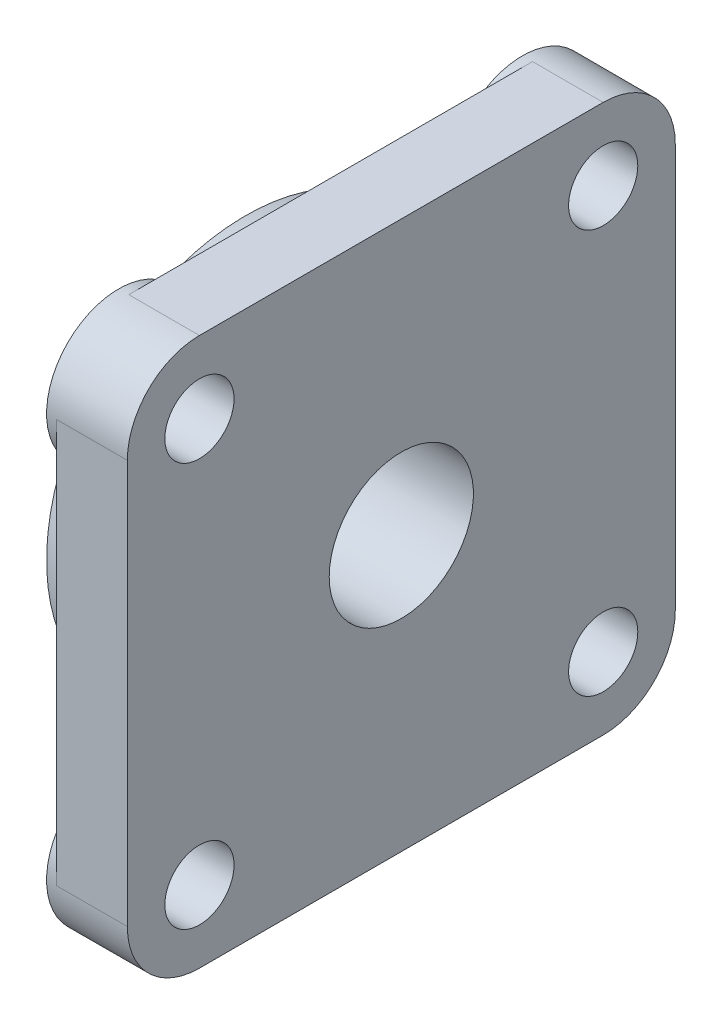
ISO-10303-21;
HEADER;
FILE_DESCRIPTION(('STEP AP214'),'2;1');
FILE_NAME('part.step','',(''),(''),'','','');
FILE_SCHEMA(('AUTOMOTIVE_DESIGN { 1 0 10303 214 1 1 1 1 }'));
ENDSEC;
DATA;
#1=APPLICATION_CONTEXT('core data for automotive mechanical design processes');
#2=APPLICATION_PROTOCOL_DEFINITION('international standard','automotive_design',2000,#1);
#3=PRODUCT_CONTEXT('',#1,'mechanical');
#4=PRODUCT('Part','Part','',(#3));
#5=PRODUCT_RELATED_PRODUCT_CATEGORY('part','',(#4));
#6=PRODUCT_DEFINITION_FORMATION('','',#4);
#7=PRODUCT_DEFINITION_CONTEXT('part definition',#1,'design');
#8=PRODUCT_DEFINITION('design','',#6,#7);
#9=PRODUCT_DEFINITION_SHAPE('','',#8);
#10=(LENGTH_UNIT() NAMED_UNIT(*) SI_UNIT(.MILLI.,.METRE.));
#11=(NAMED_UNIT(*) PLANE_ANGLE_UNIT() SI_UNIT($,.RADIAN.));
#12=(NAMED_UNIT(*) SI_UNIT($,.STERADIAN.) SOLID_ANGLE_UNIT());
#13=UNCERTAINTY_MEASURE_WITH_UNIT(LENGTH_MEASURE(1.E-05),#10,'distance_accuracy_value','');
#14=(GEOMETRIC_REPRESENTATION_CONTEXT(3) GLOBAL_UNCERTAINTY_ASSIGNED_CONTEXT((#13)) GLOBAL_UNIT_ASSIGNED_CONTEXT((#10,
#11,#12)) REPRESENTATION_CONTEXT('',''));
#15=CARTESIAN_POINT('',(0.,0.,0.));
#16=DIRECTION('',(0.,0.,1.));
#17=DIRECTION('',(1.,0.,0.));
#18=AXIS2_PLACEMENT_3D('',#15,#16,#17);
#19=CARTESIAN_POINT('',(-14.,-17.4544279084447,39.6801366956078));
#20=CARTESIAN_POINT('',(-14.,-17.4544279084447,39.3056330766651));
#21=CARTESIAN_POINT('',(-14.,-17.4544279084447,39.229087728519));
#22=CARTESIAN_POINT('',(-14.,-17.4544279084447,31.5745529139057));
#23=B_SPLINE_CURVE_WITH_KNOTS('',1,(#19,#20,#21,#22),.UNSPECIFIED.,.F.,.F.,(2,1,1,2),
(-0.0589257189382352,-0.01,0.,1.),.UNSPECIFIED.);
#24=DIRECTION('',(0.,1.,0.));
#25=VECTOR('',#24,1.);
#26=SURFACE_OF_LINEAR_EXTRUSION('',#23,#25);
#27=CARTESIAN_POINT('',(-14.,0.,0.));
#28=DIRECTION('',(1.,0.,0.));
#29=DIRECTION('',(0.,1.,0.));
#30=AXIS2_PLACEMENT_3D('',#27,#28,#29);
#31=CIRCLE('',#30,34.4974746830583);
#32=CARTESIAN_POINT('',(-14.,13.896883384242,31.5745529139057));
#33=VERTEX_POINT('',#32);
#34=CARTESIAN_POINT('',(-14.,-13.896883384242,31.5745529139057));
#35=VERTEX_POINT('',#34);
#36=EDGE_CURVE('E20',#33,#35,#31,.T.);
#37=ORIENTED_EDGE('',*,*,#36,.F.);
#38=DIRECTION('',(0.,-0.707106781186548,-0.707106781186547));
#39=VECTOR('',#38,1.);
#40=CARTESIAN_POINT('',(-14.,20.0290243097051,37.7066938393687));
#41=LINE('',#40,#39);
#42=CARTESIAN_POINT('',(-14.,17.4544280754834,35.1320976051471));
#43=VERTEX_POINT('',#42);
#44=EDGE_CURVE('E234',#43,#33,#41,.T.);
#45=ORIENTED_EDGE('',*,*,#44,.F.);
#46=CARTESIAN_POINT('',(-14.,0.,0.));
#47=DIRECTION('',(1.,0.,0.));
#48=DIRECTION('',(0.,0.,-1.));
#49=AXIS2_PLACEMENT_3D('',#46,#47,#48);
#50=CIRCLE('',#49,39.229087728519);
#51=CARTESIAN_POINT('',(-14.,-17.4544279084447,35.1320974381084));
#52=VERTEX_POINT('',#51);
#53=EDGE_CURVE('E213',#52,#43,#50,.F.);
#54=ORIENTED_EDGE('',*,*,#53,.F.);
#55=DIRECTION('',(0.,-0.707106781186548,0.707106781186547));
#56=VECTOR('',#55,1.);
#57=CARTESIAN_POINT('',(-14.,-20.0290243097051,37.7066938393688));
#58=LINE('',#57,#56);
#59=EDGE_CURVE('E211',#35,#52,#58,.T.);
#60=ORIENTED_EDGE('',*,*,#59,.F.);
#61=EDGE_LOOP('',(#37,#45,#54,#60));
#62=FACE_BOUND('',#61,.T.);
#63=ADVANCED_FACE('F16',(#62),#26,.T.);
#64=CARTESIAN_POINT('',(-12.25,0.,0.));
#65=DIRECTION('',(1.,0.,0.));
#66=DIRECTION('',(0.,1.,0.));
#67=AXIS2_PLACEMENT_3D('',#64,#65,#66);
#68=CYLINDRICAL_SURFACE('',#67,34.4974746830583);
#69=ORIENTED_EDGE('',*,*,#36,.T.);
#70=DIRECTION('',(1.,0.,0.));
#71=VECTOR('',#70,1.);
#72=CARTESIAN_POINT('',(-14.,-13.896883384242,31.5745529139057));
#73=LINE('',#72,#71);
#74=CARTESIAN_POINT('',(-12.25,-13.896883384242,31.5745529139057));
#75=VERTEX_POINT('',#74);
#76=EDGE_CURVE('E205',#75,#35,#73,.F.);
#77=ORIENTED_EDGE('',*,*,#76,.F.);
#78=CARTESIAN_POINT('',(-12.25,0.,0.));
#79=DIRECTION('',(1.,0.,0.));
#80=DIRECTION('',(0.,1.,0.));
#81=AXIS2_PLACEMENT_3D('',#78,#79,#80);
#82=CIRCLE('',#81,34.4974746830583);
#83=CARTESIAN_POINT('',(-12.25,13.896883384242,31.5745529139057));
#84=VERTEX_POINT('',#83);
#85=EDGE_CURVE('E375',#84,#75,#82,.T.);
#86=ORIENTED_EDGE('',*,*,#85,.F.);
#87=DIRECTION('',(1.,0.,0.));
#88=VECTOR('',#87,1.);
#89=CARTESIAN_POINT('',(-14.,13.896883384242,31.5745529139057));
#90=LINE('',#89,#88);
#91=EDGE_CURVE('E207',#33,#84,#90,.T.);
#92=ORIENTED_EDGE('',*,*,#91,.F.);
#93=EDGE_LOOP('',(#69,#77,#86,#92));
#94=FACE_BOUND('',#93,.T.);
#95=ADVANCED_FACE('F202',(#94),#68,.T.);
#96=CARTESIAN_POINT('',(-14.,-39.2750149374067,17.4544279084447));
#97=DIRECTION('',(1.,0.,0.));
#98=DIRECTION('',(0.,0.,-1.));
#99=AXIS2_PLACEMENT_3D('',#96,#97,#98);
#100=PLANE('',#99);
#101=DIRECTION('',(0.,0.707106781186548,-0.707106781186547));
#102=VECTOR('',#101,1.);
#103=CARTESIAN_POINT('',(-14.,-37.7066938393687,20.0290243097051));
#104=LINE('',#103,#102);
#105=CARTESIAN_POINT('',(-14.,-35.1320974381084,17.4544279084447));
#106=VERTEX_POINT('',#105);
#107=CARTESIAN_POINT('',(-14.,-31.5745529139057,13.896883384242));
#108=VERTEX_POINT('',#107);
#109=EDGE_CURVE('E415',#106,#108,#104,.T.);
#110=ORIENTED_EDGE('',*,*,#109,.F.);
#111=CARTESIAN_POINT('',(-14.,0.,0.));
#112=DIRECTION('',(1.,0.,0.));
#113=DIRECTION('',(0.,0.,-1.));
#114=AXIS2_PLACEMENT_3D('',#111,#112,#113);
#115=CIRCLE('',#114,39.229087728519);
#116=CARTESIAN_POINT('',(-14.,-35.1320974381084,-17.4544279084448));
#117=VERTEX_POINT('',#116);
#118=EDGE_CURVE('E381',#117,#106,#115,.F.);
#119=ORIENTED_EDGE('',*,*,#118,.F.);
#120=DIRECTION('',(0.,-0.707106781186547,-0.707106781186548));
#121=VECTOR('',#120,1.);
#122=CARTESIAN_POINT('',(-14.,-37.7066938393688,-20.0290243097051));
#123=LINE('',#122,#121);
#124=CARTESIAN_POINT('',(-14.,-31.5745529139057,-13.896883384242));
#125=VERTEX_POINT('',#124);
#126=EDGE_CURVE('E401',#125,#117,#123,.T.);
#127=ORIENTED_EDGE('',*,*,#126,.F.);
#128=CARTESIAN_POINT('',(-14.,0.,0.));
#129=DIRECTION('',(1.,0.,0.));
#130=DIRECTION('',(0.,0.,-1.));
#131=AXIS2_PLACEMENT_3D('',#128,#129,#130);
#132=CIRCLE('',#131,34.4974746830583);
#133=EDGE_CURVE('E209',#108,#125,#132,.T.);
#134=ORIENTED_EDGE('',*,*,#133,.F.);
#135=EDGE_LOOP('',(#110,#119,#127,#134));
#136=FACE_BOUND('',#135,.T.);
#137=ADVANCED_FACE('F402',(#136),#100,.T.);
#138=CARTESIAN_POINT('',(-12.25,0.,0.));
#139=DIRECTION('',(1.,0.,0.));
#140=DIRECTION('',(0.,0.,-1.));
#141=AXIS2_PLACEMENT_3D('',#138,#139,#140);
#142=CYLINDRICAL_SURFACE('',#141,34.4974746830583);
#143=ORIENTED_EDGE('',*,*,#133,.T.);
#144=DIRECTION('',(1.,0.,0.));
#145=VECTOR('',#144,1.);
#146=CARTESIAN_POINT('',(-14.,-31.5745529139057,-13.896883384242));
#147=LINE('',#146,#145);
#148=CARTESIAN_POINT('',(-12.25,-31.5745529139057,-13.896883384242));
#149=VERTEX_POINT('',#148);
#150=EDGE_CURVE('E388',#149,#125,#147,.F.);
#151=ORIENTED_EDGE('',*,*,#150,.F.);
#152=CARTESIAN_POINT('',(-12.25,0.,0.));
#153=DIRECTION('',(1.,0.,0.));
#154=DIRECTION('',(0.,0.,-1.));
#155=AXIS2_PLACEMENT_3D('',#152,#153,#154);
#156=CIRCLE('',#155,34.4974746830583);
#157=CARTESIAN_POINT('',(-12.25,-31.5745529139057,13.896883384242));
#158=VERTEX_POINT('',#157);
#159=EDGE_CURVE('E367',#158,#149,#156,.T.);
#160=ORIENTED_EDGE('',*,*,#159,.F.);
#161=DIRECTION('',(1.,0.,0.));
#162=VECTOR('',#161,1.);
#163=CARTESIAN_POINT('',(-14.,-31.5745529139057,13.896883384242));
#164=LINE('',#163,#162);
#165=EDGE_CURVE('E397',#108,#158,#164,.T.);
#166=ORIENTED_EDGE('',*,*,#165,.F.);
#167=EDGE_LOOP('',(#143,#151,#160,#166));
#168=FACE_BOUND('',#167,.T.);
#169=ADVANCED_FACE('F393',(#168),#142,.T.);
#170=CARTESIAN_POINT('',(-14.,-17.4544279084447,-31.5745529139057));
#171=CARTESIAN_POINT('',(-14.,-17.4544279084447,-39.229087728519));
#172=CARTESIAN_POINT('',(-14.,-17.4544279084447,-39.3056330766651));
#173=CARTESIAN_POINT('',(-14.,-17.4544279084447,-39.6801366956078));
#174=B_SPLINE_CURVE_WITH_KNOTS('',1,(#170,#171,#172,#173),.UNSPECIFIED.,.F.,.F.,(2,1,1,2),(0.,
1.,1.01,1.05892571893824),.UNSPECIFIED.);
#175=DIRECTION('',(0.,1.,0.));
#176=VECTOR('',#175,1.);
#177=SURFACE_OF_LINEAR_EXTRUSION('',#174,#176);
#178=CARTESIAN_POINT('',(-14.,0.,0.));
#179=DIRECTION('',(1.,0.,0.));
#180=DIRECTION('',(0.,1.,0.));
#181=AXIS2_PLACEMENT_3D('',#178,#179,#180);
#182=CIRCLE('',#181,34.4974746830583);
#183=CARTESIAN_POINT('',(-14.,-13.896883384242,-31.5745529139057));
#184=VERTEX_POINT('',#183);
#185=CARTESIAN_POINT('',(-14.,13.896883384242,-31.5745529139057));
#186=VERTEX_POINT('',#185);
#187=EDGE_CURVE('E389',#184,#186,#182,.T.);
#188=ORIENTED_EDGE('',*,*,#187,.F.);
#189=DIRECTION('',(0.,0.707106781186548,0.707106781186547));
#190=VECTOR('',#189,1.);
#191=CARTESIAN_POINT('',(-14.,-20.0290243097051,-37.7066938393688));
#192=LINE('',#191,#190);
#193=CARTESIAN_POINT('',(-14.,-17.4544279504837,-35.1320974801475));
#194=VERTEX_POINT('',#193);
#195=EDGE_CURVE('E715',#194,#184,#192,.T.);
#196=ORIENTED_EDGE('',*,*,#195,.F.);
#197=CARTESIAN_POINT('',(-14.,0.,0.));
#198=DIRECTION('',(1.,0.,0.));
#199=DIRECTION('',(0.,0.,-1.));
#200=AXIS2_PLACEMENT_3D('',#197,#198,#199);
#201=CIRCLE('',#200,39.229087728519);
#202=CARTESIAN_POINT('',(-14.,17.4544279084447,-35.1320974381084));
#203=VERTEX_POINT('',#202);
#204=EDGE_CURVE('E217',#203,#194,#201,.F.);
#205=ORIENTED_EDGE('',*,*,#204,.F.);
#206=DIRECTION('',(0.,0.707106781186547,-0.707106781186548));
#207=VECTOR('',#206,1.);
#208=CARTESIAN_POINT('',(-14.,20.0290243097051,-37.7066938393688));
#209=LINE('',#208,#207);
#210=EDGE_CURVE('E524',#186,#203,#209,.T.);
#211=ORIENTED_EDGE('',*,*,#210,.F.);
#212=EDGE_LOOP('',(#188,#196,#205,#211));
#213=FACE_BOUND('',#212,.T.);
#214=ADVANCED_FACE('F730',(#213),#177,.T.);
#215=CARTESIAN_POINT('',(-12.25,0.,0.));
#216=DIRECTION('',(1.,0.,0.));
#217=DIRECTION('',(0.,1.,0.));
#218=AXIS2_PLACEMENT_3D('',#215,#216,#217);
#219=CYLINDRICAL_SURFACE('',#218,34.4974746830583);
#220=ORIENTED_EDGE('',*,*,#187,.T.);
#221=DIRECTION('',(1.,0.,0.));
#222=VECTOR('',#221,1.);
#223=CARTESIAN_POINT('',(-14.,13.896883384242,-31.5745529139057));
#224=LINE('',#223,#222);
#225=CARTESIAN_POINT('',(-12.25,13.896883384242,-31.5745529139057));
#226=VERTEX_POINT('',#225);
#227=EDGE_CURVE('E406',#226,#186,#224,.F.);
#228=ORIENTED_EDGE('',*,*,#227,.F.);
#229=CARTESIAN_POINT('',(-12.25,0.,0.));
#230=DIRECTION('',(1.,0.,0.));
#231=DIRECTION('',(0.,1.,0.));
#232=AXIS2_PLACEMENT_3D('',#229,#230,#231);
#233=CIRCLE('',#232,34.4974746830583);
#234=CARTESIAN_POINT('',(-12.25,-13.896883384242,-31.5745529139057));
#235=VERTEX_POINT('',#234);
#236=EDGE_CURVE('E358',#235,#226,#233,.T.);
#237=ORIENTED_EDGE('',*,*,#236,.F.);
#238=DIRECTION('',(1.,0.,0.));
#239=VECTOR('',#238,1.);
#240=CARTESIAN_POINT('',(-14.,-13.896883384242,-31.5745529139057));
#241=LINE('',#240,#239);
#242=EDGE_CURVE('E558',#184,#235,#241,.T.);
#243=ORIENTED_EDGE('',*,*,#242,.F.);
#244=EDGE_LOOP('',(#220,#228,#237,#243));
#245=FACE_BOUND('',#244,.T.);
#246=ADVANCED_FACE('F701',(#245),#219,.T.);
#247=CARTESIAN_POINT('',(-14.,31.5286257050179,17.4544279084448));
#248=DIRECTION('',(1.,0.,0.));
#249=DIRECTION('',(0.,0.,-1.));
#250=AXIS2_PLACEMENT_3D('',#247,#248,#249);
#251=PLANE('',#250);
#252=DIRECTION('',(0.,-0.707106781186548,0.707106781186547));
#253=VECTOR('',#252,1.);
#254=CARTESIAN_POINT('',(-14.,37.7066938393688,-20.0290243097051));
#255=LINE('',#254,#253);
#256=CARTESIAN_POINT('',(-14.,35.1320974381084,-17.4544279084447));
#257=VERTEX_POINT('',#256);
#258=CARTESIAN_POINT('',(-14.,31.5745529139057,-13.8968833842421));
#259=VERTEX_POINT('',#258);
#260=EDGE_CURVE('E527',#257,#259,#255,.T.);
#261=ORIENTED_EDGE('',*,*,#260,.F.);
#262=CARTESIAN_POINT('',(-14.,0.,0.));
#263=DIRECTION('',(1.,0.,0.));
#264=DIRECTION('',(0.,0.,-1.));
#265=AXIS2_PLACEMENT_3D('',#262,#263,#264);
#266=CIRCLE('',#265,39.229087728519);
#267=CARTESIAN_POINT('',(-14.,35.1320974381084,17.4544279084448));
#268=VERTEX_POINT('',#267);
#269=EDGE_CURVE('E377',#268,#257,#266,.F.);
#270=ORIENTED_EDGE('',*,*,#269,.F.);
#271=DIRECTION('',(0.,0.707106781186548,0.707106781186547));
#272=VECTOR('',#271,1.);
#273=CARTESIAN_POINT('',(-14.,37.7066938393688,20.0290243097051));
#274=LINE('',#273,#272);
#275=CARTESIAN_POINT('',(-14.,31.5745529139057,13.896883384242));
#276=VERTEX_POINT('',#275);
#277=EDGE_CURVE('E223',#276,#268,#274,.T.);
#278=ORIENTED_EDGE('',*,*,#277,.F.);
#279=CARTESIAN_POINT('',(-14.,0.,0.));
#280=DIRECTION('',(1.,0.,0.));
#281=DIRECTION('',(0.,0.,-1.));
#282=AXIS2_PLACEMENT_3D('',#279,#280,#281);
#283=CIRCLE('',#282,34.4974746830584);
#284=EDGE_CURVE('E386',#259,#276,#283,.T.);
#285=ORIENTED_EDGE('',*,*,#284,.F.);
#286=EDGE_LOOP('',(#261,#270,#278,#285));
#287=FACE_BOUND('',#286,.T.);
#288=ADVANCED_FACE('F830',(#287),#251,.T.);
#289=CARTESIAN_POINT('',(-12.25,0.,0.));
#290=DIRECTION('',(1.,0.,0.));
#291=DIRECTION('',(0.,0.,-1.));
#292=AXIS2_PLACEMENT_3D('',#289,#290,#291);
#293=CYLINDRICAL_SURFACE('',#292,34.4974746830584);
#294=ORIENTED_EDGE('',*,*,#284,.T.);
#295=DIRECTION('',(1.,0.,0.));
#296=VECTOR('',#295,1.);
#297=CARTESIAN_POINT('',(-14.,31.5745529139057,13.896883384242));
#298=LINE('',#297,#296);
#299=CARTESIAN_POINT('',(-12.25,31.5745529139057,13.896883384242));
#300=VERTEX_POINT('',#299);
#301=EDGE_CURVE('E226',#300,#276,#298,.F.);
#302=ORIENTED_EDGE('',*,*,#301,.F.);
#303=CARTESIAN_POINT('',(-12.25,0.,0.));
#304=DIRECTION('',(1.,0.,0.));
#305=DIRECTION('',(0.,0.,-1.));
#306=AXIS2_PLACEMENT_3D('',#303,#304,#305);
#307=CIRCLE('',#306,34.4974746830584);
#308=CARTESIAN_POINT('',(-12.25,31.5745529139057,-13.896883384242));
#309=VERTEX_POINT('',#308);
#310=EDGE_CURVE('E349',#309,#300,#307,.T.);
#311=ORIENTED_EDGE('',*,*,#310,.F.);
#312=DIRECTION('',(1.,0.,0.));
#313=VECTOR('',#312,1.);
#314=CARTESIAN_POINT('',(-14.,31.5745529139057,-13.8968833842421));
#315=LINE('',#314,#313);
#316=EDGE_CURVE('E525',#259,#309,#315,.T.);
#317=ORIENTED_EDGE('',*,*,#316,.F.);
#318=EDGE_LOOP('',(#294,#302,#311,#317));
#319=FACE_BOUND('',#318,.T.);
#320=ADVANCED_FACE('F828',(#319),#293,.T.);
#321=CARTESIAN_POINT('',(-14.,-31.5745529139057,-13.896883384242));
#322=DIRECTION('',(0.,-0.707106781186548,0.707106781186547));
#323=DIRECTION('',(0.,-0.707106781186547,-0.707106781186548));
#324=AXIS2_PLACEMENT_3D('',#321,#322,#323);
#325=PLANE('',#324);
#326=CARTESIAN_POINT('',(-14.,-43.8388347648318,-26.1611652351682));
#327=CARTESIAN_POINT('',(-14.,-43.476054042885,-25.7983845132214));
#328=CARTESIAN_POINT('',(-14.,-43.1132733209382,-25.4356037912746));
#329=CARTESIAN_POINT('',(-14.,-42.3877118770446,-24.7100423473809));
#330=CARTESIAN_POINT('',(-14.,-42.0249311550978,-24.3472616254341));
#331=CARTESIAN_POINT('',(-14.,-41.2993697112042,-23.6217001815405));
#332=CARTESIAN_POINT('',(-14.,-40.9365889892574,-23.2589194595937));
#333=CARTESIAN_POINT('',(-14.,-40.2110275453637,-22.5333580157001));
#334=CARTESIAN_POINT('',(-14.,-39.848246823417,-22.1705772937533));
#335=CARTESIAN_POINT('',(-14.,-39.1226853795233,-21.4450158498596));
#336=CARTESIAN_POINT('',(-14.,-38.7599046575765,-21.0822351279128));
#337=CARTESIAN_POINT('',(-14.,-38.0343432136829,-20.3566736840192));
#338=CARTESIAN_POINT('',(-14.,-37.6715624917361,-19.9938929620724));
#339=CARTESIAN_POINT('',(-14.,-36.9460010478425,-19.2683315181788));
#340=CARTESIAN_POINT('',(-14.,-36.5832203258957,-18.905550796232));
#341=CARTESIAN_POINT('',(-14.,-35.857658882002,-18.1799893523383));
#342=CARTESIAN_POINT('',(-14.,-35.4948781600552,-17.8172086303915));
#343=CARTESIAN_POINT('',(-14.,-35.1320974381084,-17.4544279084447));
#344=B_SPLINE_CURVE_WITH_KNOTS('',3,(#326,#327,#328,#329,#330,#331,#332,#333,#334,#335,#336,
#337,#338,#339,#340,#341,#342,#343),.UNSPECIFIED.,.F.,.F.,(4,2,2,2,2,2,2,2,4),(0.,
1.53914825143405,3.07829650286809,4.61744475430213,6.15659300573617,7.69574125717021,
9.23488950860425,10.7740377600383,12.3131860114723),.UNSPECIFIED.);
#345=CARTESIAN_POINT('',(-14.,-43.8388347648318,-26.1611652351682));
#346=VERTEX_POINT('',#345);
#347=EDGE_CURVE('E345',#346,#117,#344,.T.);
#348=ORIENTED_EDGE('',*,*,#347,.F.);
#349=DIRECTION('',(-1.,0.,0.));
#350=VECTOR('',#349,1.);
#351=CARTESIAN_POINT('',(-13.125,-43.8388347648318,-26.1611652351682));
#352=LINE('',#351,#350);
#353=CARTESIAN_POINT('',(-12.25,-43.8388347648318,-26.1611652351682));
#354=VERTEX_POINT('',#353);
#355=EDGE_CURVE('E365',#354,#346,#352,.T.);
#356=ORIENTED_EDGE('',*,*,#355,.F.);
#357=CARTESIAN_POINT('',(-12.25,-31.5745529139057,-13.896883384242));
#358=CARTESIAN_POINT('',(-12.25,-32.0855646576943,-14.4078951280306));
#359=CARTESIAN_POINT('',(-12.25,-32.5965764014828,-14.9189068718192));
#360=CARTESIAN_POINT('',(-12.25,-33.61859988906,-15.9409303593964));
#361=CARTESIAN_POINT('',(-12.25,-34.1296116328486,-16.4519421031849));
#362=CARTESIAN_POINT('',(-12.25,-35.1516351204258,-17.4739655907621));
#363=CARTESIAN_POINT('',(-12.25,-35.6626468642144,-17.9849773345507));
#364=CARTESIAN_POINT('',(-12.25,-36.6846703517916,-19.0070008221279));
#365=CARTESIAN_POINT('',(-12.25,-37.1956820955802,-19.5180125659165));
#366=CARTESIAN_POINT('',(-12.25,-38.2177055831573,-20.5400360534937));
#367=CARTESIAN_POINT('',(-12.25,-38.7287173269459,-21.0510477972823));
#368=CARTESIAN_POINT('',(-12.25,-39.7507408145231,-22.0730712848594));
#369=CARTESIAN_POINT('',(-12.25,-40.2617525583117,-22.584083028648));
#370=CARTESIAN_POINT('',(-12.25,-41.2837760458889,-23.6061065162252));
#371=CARTESIAN_POINT('',(-12.25,-41.7947877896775,-24.1171182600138));
#372=CARTESIAN_POINT('',(-12.25,-42.8168112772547,-25.139141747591));
#373=CARTESIAN_POINT('',(-12.25,-43.3278230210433,-25.6501534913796));
#374=CARTESIAN_POINT('',(-12.25,-43.8388347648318,-26.1611652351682));
#375=B_SPLINE_CURVE_WITH_KNOTS('',3,(#357,#358,#359,#360,#361,#362,#363,#364,#365,#366,#367,
#368,#369,#370,#371,#372,#373,#374),.UNSPECIFIED.,.F.,.F.,(4,2,2,2,2,2,2,2,4),(0.,
2.16803921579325,4.3360784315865,6.50411764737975,8.672156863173,10.8401960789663,
13.0082352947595,15.1762745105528,17.344313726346),.UNSPECIFIED.);
#376=EDGE_CURVE('E366',#149,#354,#375,.T.);
#377=ORIENTED_EDGE('',*,*,#376,.F.);
#378=ORIENTED_EDGE('',*,*,#150,.T.);
#379=ORIENTED_EDGE('',*,*,#126,.T.);
#380=EDGE_LOOP('',(#348,#356,#377,#378,#379));
#381=FACE_BOUND('',#380,.T.);
#382=ADVANCED_FACE('F408',(#381),#325,.T.);
#383=CARTESIAN_POINT('',(-14.,13.896883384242,-31.5745529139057));
#384=DIRECTION('',(0.,-0.707106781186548,-0.707106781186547));
#385=DIRECTION('',(0.,0.707106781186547,-0.707106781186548));
#386=AXIS2_PLACEMENT_3D('',#383,#384,#385);
#387=PLANE('',#386);
#388=CARTESIAN_POINT('',(-14.,26.1611652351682,-43.8388347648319));
#389=CARTESIAN_POINT('',(-14.,25.7983845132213,-43.4760540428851));
#390=CARTESIAN_POINT('',(-14.,25.4356037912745,-43.1132733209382));
#391=CARTESIAN_POINT('',(-14.,24.7100423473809,-42.3877118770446));
#392=CARTESIAN_POINT('',(-14.,24.3472616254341,-42.0249311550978));
#393=CARTESIAN_POINT('',(-14.,23.6217001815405,-41.2993697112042));
#394=CARTESIAN_POINT('',(-14.,23.2589194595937,-40.9365889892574));
#395=CARTESIAN_POINT('',(-14.,22.5333580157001,-40.2110275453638));
#396=CARTESIAN_POINT('',(-14.,22.1705772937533,-39.848246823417));
#397=CARTESIAN_POINT('',(-14.,21.4450158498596,-39.1226853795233));
#398=CARTESIAN_POINT('',(-14.,21.0822351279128,-38.7599046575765));
#399=CARTESIAN_POINT('',(-14.,20.3566736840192,-38.0343432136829));
#400=CARTESIAN_POINT('',(-14.,19.9938929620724,-37.6715624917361));
#401=CARTESIAN_POINT('',(-14.,19.2683315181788,-36.9460010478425));
#402=CARTESIAN_POINT('',(-14.,18.905550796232,-36.5832203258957));
#403=CARTESIAN_POINT('',(-14.,18.1799893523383,-35.857658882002));
#404=CARTESIAN_POINT('',(-14.,17.8172086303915,-35.4948781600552));
#405=CARTESIAN_POINT('',(-14.,17.4544279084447,-35.1320974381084));
#406=B_SPLINE_CURVE_WITH_KNOTS('',3,(#388,#389,#390,#391,#392,#393,#394,#395,#396,#397,#398,
#399,#400,#401,#402,#403,#404,#405),.UNSPECIFIED.,.F.,.F.,(4,2,2,2,2,2,2,2,4),(0.,
1.53914825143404,3.07829650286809,4.61744475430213,6.15659300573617,7.69574125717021,
9.23488950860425,10.7740377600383,12.3131860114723),.UNSPECIFIED.);
#407=CARTESIAN_POINT('',(-14.,26.1611652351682,-43.8388347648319));
#408=VERTEX_POINT('',#407);
#409=EDGE_CURVE('E340',#408,#203,#406,.T.);
#410=ORIENTED_EDGE('',*,*,#409,.F.);
#411=DIRECTION('',(-1.,0.,0.));
#412=VECTOR('',#411,1.);
#413=CARTESIAN_POINT('',(-13.125,26.1611652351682,-43.8388347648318));
#414=LINE('',#413,#412);
#415=CARTESIAN_POINT('',(-12.25,26.1611652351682,-43.8388347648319));
#416=VERTEX_POINT('',#415);
#417=EDGE_CURVE('E356',#416,#408,#414,.T.);
#418=ORIENTED_EDGE('',*,*,#417,.F.);
#419=CARTESIAN_POINT('',(-12.25,13.896883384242,-31.5745529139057));
#420=CARTESIAN_POINT('',(-12.25,14.4078951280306,-32.0855646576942));
#421=CARTESIAN_POINT('',(-12.25,14.9189068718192,-32.5965764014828));
#422=CARTESIAN_POINT('',(-12.25,15.9409303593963,-33.61859988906));
#423=CARTESIAN_POINT('',(-12.25,16.4519421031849,-34.1296116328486));
#424=CARTESIAN_POINT('',(-12.25,17.4739655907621,-35.1516351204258));
#425=CARTESIAN_POINT('',(-12.25,17.9849773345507,-35.6626468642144));
#426=CARTESIAN_POINT('',(-12.25,19.0070008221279,-36.6846703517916));
#427=CARTESIAN_POINT('',(-12.25,19.5180125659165,-37.1956820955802));
#428=CARTESIAN_POINT('',(-12.25,20.5400360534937,-38.2177055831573));
#429=CARTESIAN_POINT('',(-12.25,21.0510477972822,-38.7287173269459));
#430=CARTESIAN_POINT('',(-12.25,22.0730712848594,-39.7507408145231));
#431=CARTESIAN_POINT('',(-12.25,22.584083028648,-40.2617525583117));
#432=CARTESIAN_POINT('',(-12.25,23.6061065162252,-41.2837760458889));
#433=CARTESIAN_POINT('',(-12.25,24.1171182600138,-41.7947877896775));
#434=CARTESIAN_POINT('',(-12.25,25.139141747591,-42.8168112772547));
#435=CARTESIAN_POINT('',(-12.25,25.6501534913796,-43.3278230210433));
#436=CARTESIAN_POINT('',(-12.25,26.1611652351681,-43.8388347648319));
#437=B_SPLINE_CURVE_WITH_KNOTS('',3,(#419,#420,#421,#422,#423,#424,#425,#426,#427,#428,#429,
#430,#431,#432,#433,#434,#435,#436),.UNSPECIFIED.,.F.,.F.,(4,2,2,2,2,2,2,2,4),(0.,
2.16803921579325,4.3360784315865,6.50411764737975,8.672156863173,10.8401960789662,
13.0082352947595,15.1762745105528,17.344313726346),.UNSPECIFIED.);
#438=EDGE_CURVE('E357',#226,#416,#437,.T.);
#439=ORIENTED_EDGE('',*,*,#438,.F.);
#440=ORIENTED_EDGE('',*,*,#227,.T.);
#441=ORIENTED_EDGE('',*,*,#210,.T.);
#442=EDGE_LOOP('',(#410,#418,#439,#440,#441));
#443=FACE_BOUND('',#442,.T.);
#444=ADVANCED_FACE('F707',(#443),#387,.T.);
#445=CARTESIAN_POINT('',(-14.,31.5745529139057,13.896883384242));
#446=DIRECTION('',(0.,0.707106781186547,-0.707106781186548));
#447=DIRECTION('',(0.,0.707106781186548,0.707106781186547));
#448=AXIS2_PLACEMENT_3D('',#445,#446,#447);
#449=PLANE('',#448);
#450=CARTESIAN_POINT('',(-14.,43.8388347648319,26.1611652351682));
#451=CARTESIAN_POINT('',(-14.,43.476054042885,25.7983845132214));
#452=CARTESIAN_POINT('',(-14.,43.1132733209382,25.4356037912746));
#453=CARTESIAN_POINT('',(-14.,42.3877118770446,24.710042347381));
#454=CARTESIAN_POINT('',(-14.,42.0249311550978,24.3472616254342));
#455=CARTESIAN_POINT('',(-14.,41.2993697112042,23.6217001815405));
#456=CARTESIAN_POINT('',(-14.,40.9365889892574,23.2589194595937));
#457=CARTESIAN_POINT('',(-14.,40.2110275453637,22.5333580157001));
#458=CARTESIAN_POINT('',(-14.,39.8482468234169,22.1705772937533));
#459=CARTESIAN_POINT('',(-14.,39.1226853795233,21.4450158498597));
#460=CARTESIAN_POINT('',(-14.,38.7599046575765,21.0822351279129));
#461=CARTESIAN_POINT('',(-14.,38.0343432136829,20.3566736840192));
#462=CARTESIAN_POINT('',(-14.,37.6715624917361,19.9938929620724));
#463=CARTESIAN_POINT('',(-14.,36.9460010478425,19.2683315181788));
#464=CARTESIAN_POINT('',(-14.,36.5832203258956,18.905550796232));
#465=CARTESIAN_POINT('',(-14.,35.857658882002,18.1799893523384));
#466=CARTESIAN_POINT('',(-14.,35.4948781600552,17.8172086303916));
#467=CARTESIAN_POINT('',(-14.,35.1320974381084,17.4544279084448));
#468=B_SPLINE_CURVE_WITH_KNOTS('',3,(#450,#451,#452,#453,#454,#455,#456,#457,#458,#459,#460,
#461,#462,#463,#464,#465,#466,#467),.UNSPECIFIED.,.F.,.F.,(4,2,2,2,2,2,2,2,4),(0.,
1.53914825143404,3.07829650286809,4.61744475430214,6.15659300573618,7.69574125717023,
9.23488950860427,10.7740377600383,12.3131860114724),.UNSPECIFIED.);
#469=CARTESIAN_POINT('',(-14.,43.8388347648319,26.1611652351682));
#470=VERTEX_POINT('',#469);
#471=EDGE_CURVE('E335',#470,#268,#468,.T.);
#472=ORIENTED_EDGE('',*,*,#471,.F.);
#473=DIRECTION('',(-1.,0.,0.));
#474=VECTOR('',#473,1.);
#475=CARTESIAN_POINT('',(-13.125,43.8388347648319,26.1611652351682));
#476=LINE('',#475,#474);
#477=CARTESIAN_POINT('',(-12.25,43.8388347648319,26.1611652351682));
#478=VERTEX_POINT('',#477);
#479=EDGE_CURVE('E379',#478,#470,#476,.T.);
#480=ORIENTED_EDGE('',*,*,#479,.F.);
#481=CARTESIAN_POINT('',(-12.25,31.5745529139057,13.896883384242));
#482=CARTESIAN_POINT('',(-12.25,32.0855646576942,14.4078951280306));
#483=CARTESIAN_POINT('',(-12.25,32.5965764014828,14.9189068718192));
#484=CARTESIAN_POINT('',(-12.25,33.61859988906,15.9409303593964));
#485=CARTESIAN_POINT('',(-12.25,34.1296116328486,16.451942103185));
#486=CARTESIAN_POINT('',(-12.25,35.1516351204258,17.4739655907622));
#487=CARTESIAN_POINT('',(-12.25,35.6626468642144,17.9849773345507));
#488=CARTESIAN_POINT('',(-12.25,36.6846703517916,19.0070008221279));
#489=CARTESIAN_POINT('',(-12.25,37.1956820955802,19.5180125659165));
#490=CARTESIAN_POINT('',(-12.25,38.2177055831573,20.5400360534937));
#491=CARTESIAN_POINT('',(-12.25,38.7287173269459,21.0510477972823));
#492=CARTESIAN_POINT('',(-12.25,39.7507408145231,22.0730712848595));
#493=CARTESIAN_POINT('',(-12.25,40.2617525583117,22.5840830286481));
#494=CARTESIAN_POINT('',(-12.25,41.2837760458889,23.6061065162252));
#495=CARTESIAN_POINT('',(-12.25,41.7947877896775,24.1171182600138));
#496=CARTESIAN_POINT('',(-12.25,42.8168112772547,25.139141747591));
#497=CARTESIAN_POINT('',(-12.25,43.3278230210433,25.6501534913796));
#498=CARTESIAN_POINT('',(-12.25,43.8388347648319,26.1611652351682));
#499=B_SPLINE_CURVE_WITH_KNOTS('',3,(#481,#482,#483,#484,#485,#486,#487,#488,#489,#490,#491,
#492,#493,#494,#495,#496,#497,#498),.UNSPECIFIED.,.F.,.F.,(4,2,2,2,2,2,2,2,4),(0.,
2.16803921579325,4.3360784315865,6.50411764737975,8.67215686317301,10.8401960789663,
13.0082352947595,15.1762745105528,17.344313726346),.UNSPECIFIED.);
#500=EDGE_CURVE('E348',#300,#478,#499,.T.);
#501=ORIENTED_EDGE('',*,*,#500,.F.);
#502=ORIENTED_EDGE('',*,*,#301,.T.);
#503=ORIENTED_EDGE('',*,*,#277,.T.);
#504=EDGE_LOOP('',(#472,#480,#501,#502,#503));
#505=FACE_BOUND('',#504,.T.);
#506=ADVANCED_FACE('F635',(#505),#449,.T.);
#507=CARTESIAN_POINT('',(-14.,-13.896883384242,31.5745529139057));
#508=DIRECTION('',(0.,0.707106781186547,0.707106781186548));
#509=DIRECTION('',(0.,-0.707106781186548,0.707106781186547));
#510=AXIS2_PLACEMENT_3D('',#507,#508,#509);
#511=PLANE('',#510);
#512=CARTESIAN_POINT('',(-14.,-26.1611652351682,43.8388347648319));
#513=CARTESIAN_POINT('',(-14.,-25.7983845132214,43.476054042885));
#514=CARTESIAN_POINT('',(-14.,-25.4356037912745,43.1132733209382));
#515=CARTESIAN_POINT('',(-14.,-24.7100423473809,42.3877118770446));
#516=CARTESIAN_POINT('',(-14.,-24.3472616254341,42.0249311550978));
#517=CARTESIAN_POINT('',(-14.,-23.6217001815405,41.2993697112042));
#518=CARTESIAN_POINT('',(-14.,-23.2589194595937,40.9365889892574));
#519=CARTESIAN_POINT('',(-14.,-22.5333580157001,40.2110275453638));
#520=CARTESIAN_POINT('',(-14.,-22.1705772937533,39.848246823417));
#521=CARTESIAN_POINT('',(-14.,-21.4450158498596,39.1226853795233));
#522=CARTESIAN_POINT('',(-14.,-21.0822351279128,38.7599046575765));
#523=CARTESIAN_POINT('',(-14.,-20.3566736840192,38.0343432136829));
#524=CARTESIAN_POINT('',(-14.,-19.9938929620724,37.6715624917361));
#525=CARTESIAN_POINT('',(-14.,-19.2683315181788,36.9460010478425));
#526=CARTESIAN_POINT('',(-14.,-18.905550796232,36.5832203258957));
#527=CARTESIAN_POINT('',(-14.,-18.1799893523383,35.857658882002));
#528=CARTESIAN_POINT('',(-14.,-17.8172086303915,35.4948781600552));
#529=CARTESIAN_POINT('',(-14.,-17.4544279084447,35.1320974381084));
#530=B_SPLINE_CURVE_WITH_KNOTS('',3,(#512,#513,#514,#515,#516,#517,#518,#519,#520,#521,#522,
#523,#524,#525,#526,#527,#528,#529),.UNSPECIFIED.,.F.,.F.,(4,2,2,2,2,2,2,2,4),(0.,
1.53914825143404,3.07829650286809,4.61744475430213,6.15659300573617,7.69574125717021,
9.23488950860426,10.7740377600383,12.3131860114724),.UNSPECIFIED.);
#531=CARTESIAN_POINT('',(-14.,-26.1611652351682,43.8388347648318));
#532=VERTEX_POINT('',#531);
#533=EDGE_CURVE('E331',#532,#52,#530,.T.);
#534=ORIENTED_EDGE('',*,*,#533,.F.);
#535=DIRECTION('',(-1.,0.,0.));
#536=VECTOR('',#535,1.);
#537=CARTESIAN_POINT('',(-13.125,-26.1611652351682,43.8388347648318));
#538=LINE('',#537,#536);
#539=CARTESIAN_POINT('',(-12.25,-26.1611652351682,43.8388347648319));
#540=VERTEX_POINT('',#539);
#541=EDGE_CURVE('E374',#540,#532,#538,.T.);
#542=ORIENTED_EDGE('',*,*,#541,.F.);
#543=CARTESIAN_POINT('',(-12.25,-13.896883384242,31.5745529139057));
#544=CARTESIAN_POINT('',(-12.25,-14.4078951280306,32.0855646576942));
#545=CARTESIAN_POINT('',(-12.25,-14.9189068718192,32.5965764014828));
#546=CARTESIAN_POINT('',(-12.25,-15.9409303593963,33.61859988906));
#547=CARTESIAN_POINT('',(-12.25,-16.4519421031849,34.1296116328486));
#548=CARTESIAN_POINT('',(-12.25,-17.4739655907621,35.1516351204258));
#549=CARTESIAN_POINT('',(-12.25,-17.9849773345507,35.6626468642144));
#550=CARTESIAN_POINT('',(-12.25,-19.0070008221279,36.6846703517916));
#551=CARTESIAN_POINT('',(-12.25,-19.5180125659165,37.1956820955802));
#552=CARTESIAN_POINT('',(-12.25,-20.5400360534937,38.2177055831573));
#553=CARTESIAN_POINT('',(-12.25,-21.0510477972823,38.7287173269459));
#554=CARTESIAN_POINT('',(-12.25,-22.0730712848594,39.7507408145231));
#555=CARTESIAN_POINT('',(-12.25,-22.584083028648,40.2617525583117));
#556=CARTESIAN_POINT('',(-12.25,-23.6061065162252,41.2837760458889));
#557=CARTESIAN_POINT('',(-12.25,-24.1171182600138,41.7947877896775));
#558=CARTESIAN_POINT('',(-12.25,-25.139141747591,42.8168112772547));
#559=CARTESIAN_POINT('',(-12.25,-25.6501534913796,43.3278230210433));
#560=CARTESIAN_POINT('',(-12.25,-26.1611652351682,43.8388347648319));
#561=B_SPLINE_CURVE_WITH_KNOTS('',3,(#543,#544,#545,#546,#547,#548,#549,#550,#551,#552,#553,
#554,#555,#556,#557,#558,#559,#560),.UNSPECIFIED.,.F.,.F.,(4,2,2,2,2,2,2,2,4),(0.,
2.16803921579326,4.33607843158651,6.50411764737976,8.67215686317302,10.8401960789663,
13.0082352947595,15.1762745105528,17.344313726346),.UNSPECIFIED.);
#562=EDGE_CURVE('E221',#75,#540,#561,.T.);
#563=ORIENTED_EDGE('',*,*,#562,.F.);
#564=ORIENTED_EDGE('',*,*,#76,.T.);
#565=ORIENTED_EDGE('',*,*,#59,.T.);
#566=EDGE_LOOP('',(#534,#542,#563,#564,#565));
#567=FACE_BOUND('',#566,.T.);
#568=ADVANCED_FACE('F219',(#567),#511,.T.);
#569=CARTESIAN_POINT('',(-27.,0.,0.));
#570=DIRECTION('',(1.,0.,0.));
#571=DIRECTION('',(0.,0.,-1.));
#572=AXIS2_PLACEMENT_3D('',#569,#570,#571);
#573=CONICAL_SURFACE('',#572,34.4974746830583,0.349065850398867);
#574=CARTESIAN_POINT('',(-27.,0.,0.));
#575=DIRECTION('',(1.,0.,0.));
#576=DIRECTION('',(0.,0.,-1.));
#577=AXIS2_PLACEMENT_3D('',#574,#575,#576);
#578=CIRCLE('',#577,34.4974746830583);
#579=CARTESIAN_POINT('',(-27.,0.,-34.4974746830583));
#580=VERTEX_POINT('',#579);
#581=EDGE_CURVE('E324',#580,#580,#578,.F.);
#582=ORIENTED_EDGE('',*,*,#581,.F.);
#583=EDGE_LOOP('',(#582));
#584=FACE_BOUND('',#583,.T.);
#585=CARTESIAN_POINT('',(-14.,0.,0.));
#586=DIRECTION('',(1.,0.,0.));
#587=DIRECTION('',(0.,0.,-1.));
#588=AXIS2_PLACEMENT_3D('',#585,#586,#587);
#589=CIRCLE('',#588,39.229087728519);
#590=EDGE_CURVE('E332',#268,#43,#589,.T.);
#591=ORIENTED_EDGE('',*,*,#590,.F.);
#592=ORIENTED_EDGE('',*,*,#269,.T.);
#593=CARTESIAN_POINT('',(-14.,0.,0.));
#594=DIRECTION('',(1.,0.,0.));
#595=DIRECTION('',(0.,0.,-1.));
#596=AXIS2_PLACEMENT_3D('',#593,#594,#595);
#597=CIRCLE('',#596,39.229087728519);
#598=EDGE_CURVE('E336',#203,#257,#597,.T.);
#599=ORIENTED_EDGE('',*,*,#598,.F.);
#600=ORIENTED_EDGE('',*,*,#204,.T.);
#601=CARTESIAN_POINT('',(-14.,0.,0.));
#602=DIRECTION('',(1.,0.,0.));
#603=DIRECTION('',(0.,0.,-1.));
#604=AXIS2_PLACEMENT_3D('',#601,#602,#603);
#605=CIRCLE('',#604,39.229087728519);
#606=EDGE_CURVE('E341',#117,#194,#605,.T.);
#607=ORIENTED_EDGE('',*,*,#606,.F.);
#608=ORIENTED_EDGE('',*,*,#118,.T.);
#609=CARTESIAN_POINT('',(-14.,0.,0.));
#610=DIRECTION('',(1.,0.,0.));
#611=DIRECTION('',(0.,0.,-1.));
#612=AXIS2_PLACEMENT_3D('',#609,#610,#611);
#613=CIRCLE('',#612,39.229087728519);
#614=EDGE_CURVE('E328',#52,#106,#613,.T.);
#615=ORIENTED_EDGE('',*,*,#614,.F.);
#616=ORIENTED_EDGE('',*,*,#53,.T.);
#617=EDGE_LOOP('',(#591,#592,#599,#600,#607,#608,#615,#616));
#618=FACE_BOUND('',#617,.T.);
#619=ADVANCED_FACE('F639',(#584,#618),#573,.T.);
#620=CARTESIAN_POINT('',(-14.,26.1611652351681,43.8388347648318));
#621=DIRECTION('',(0.,-0.707106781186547,0.707106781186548));
#622=DIRECTION('',(0.,-0.707106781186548,-0.707106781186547));
#623=AXIS2_PLACEMENT_3D('',#620,#621,#622);
#624=PLANE('',#623);
#625=ORIENTED_EDGE('',*,*,#44,.T.);
#626=ORIENTED_EDGE('',*,*,#91,.T.);
#627=CARTESIAN_POINT('',(-12.25,26.1611652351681,43.8388347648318));
#628=CARTESIAN_POINT('',(-12.25,25.6501534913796,43.3278230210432));
#629=CARTESIAN_POINT('',(-12.25,25.139141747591,42.8168112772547));
#630=CARTESIAN_POINT('',(-12.25,24.1171182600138,41.7947877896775));
#631=CARTESIAN_POINT('',(-12.25,23.6061065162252,41.2837760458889));
#632=CARTESIAN_POINT('',(-12.25,22.584083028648,40.2617525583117));
#633=CARTESIAN_POINT('',(-12.25,22.0730712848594,39.7507408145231));
#634=CARTESIAN_POINT('',(-12.25,21.0510477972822,38.7287173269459));
#635=CARTESIAN_POINT('',(-12.25,20.5400360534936,38.2177055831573));
#636=CARTESIAN_POINT('',(-12.25,19.5180125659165,37.1956820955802));
#637=CARTESIAN_POINT('',(-12.25,19.0070008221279,36.6846703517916));
#638=CARTESIAN_POINT('',(-12.25,17.9849773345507,35.6626468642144));
#639=CARTESIAN_POINT('',(-12.25,17.4739655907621,35.1516351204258));
#640=CARTESIAN_POINT('',(-12.25,16.4519421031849,34.1296116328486));
#641=CARTESIAN_POINT('',(-12.25,15.9409303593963,33.61859988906));
#642=CARTESIAN_POINT('',(-12.25,14.9189068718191,32.5965764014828));
#643=CARTESIAN_POINT('',(-12.25,14.4078951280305,32.0855646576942));
#644=CARTESIAN_POINT('',(-12.25,13.896883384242,31.5745529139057));
#645=B_SPLINE_CURVE_WITH_KNOTS('',3,(#627,#628,#629,#630,#631,#632,#633,#634,#635,#636,#637,
#638,#639,#640,#641,#642,#643,#644),.UNSPECIFIED.,.F.,.F.,(4,2,2,2,2,2,2,2,4),(0.,
2.16803921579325,4.3360784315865,6.50411764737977,8.67215686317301,10.8401960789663,
13.0082352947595,15.1762745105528,17.344313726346),.UNSPECIFIED.);
#646=CARTESIAN_POINT('',(-12.25,26.1611652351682,43.8388347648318));
#647=VERTEX_POINT('',#646);
#648=EDGE_CURVE('E233',#647,#84,#645,.T.);
#649=ORIENTED_EDGE('',*,*,#648,.F.);
#650=DIRECTION('',(1.,0.,0.));
#651=VECTOR('',#650,1.);
#652=CARTESIAN_POINT('',(-7.,26.1611652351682,43.8388347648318));
#653=LINE('',#652,#651);
#654=CARTESIAN_POINT('',(-14.,26.1611652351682,43.8388347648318));
#655=VERTEX_POINT('',#654);
#656=EDGE_CURVE('E320',#655,#647,#653,.T.);
#657=ORIENTED_EDGE('',*,*,#656,.F.);
#658=CARTESIAN_POINT('',(-14.,17.4544279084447,35.1320974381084));
#659=CARTESIAN_POINT('',(-14.,17.8172086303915,35.4948781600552));
#660=CARTESIAN_POINT('',(-14.,18.1799893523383,35.857658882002));
#661=CARTESIAN_POINT('',(-14.,18.9055507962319,36.5832203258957));
#662=CARTESIAN_POINT('',(-14.,19.2683315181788,36.9460010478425));
#663=CARTESIAN_POINT('',(-14.,19.9938929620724,37.6715624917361));
#664=CARTESIAN_POINT('',(-14.,20.3566736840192,38.0343432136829));
#665=CARTESIAN_POINT('',(-14.,21.0822351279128,38.7599046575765));
#666=CARTESIAN_POINT('',(-14.,21.4450158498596,39.1226853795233));
#667=CARTESIAN_POINT('',(-14.,22.1705772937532,39.8482468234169));
#668=CARTESIAN_POINT('',(-14.,22.5333580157,40.2110275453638));
#669=CARTESIAN_POINT('',(-14.,23.2589194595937,40.9365889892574));
#670=CARTESIAN_POINT('',(-14.,23.6217001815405,41.2993697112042));
#671=CARTESIAN_POINT('',(-14.,24.3472616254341,42.0249311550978));
#672=CARTESIAN_POINT('',(-14.,24.7100423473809,42.3877118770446));
#673=CARTESIAN_POINT('',(-14.,25.4356037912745,43.1132733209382));
#674=CARTESIAN_POINT('',(-14.,25.7983845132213,43.476054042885));
#675=CARTESIAN_POINT('',(-14.,26.1611652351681,43.8388347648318));
#676=B_SPLINE_CURVE_WITH_KNOTS('',3,(#658,#659,#660,#661,#662,#663,#664,#665,#666,#667,#668,
#669,#670,#671,#672,#673,#674,#675),.UNSPECIFIED.,.F.,.F.,(4,2,2,2,2,2,2,2,4),(0.,
1.53914825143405,3.07829650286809,4.61744475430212,6.15659300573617,7.69574125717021,
9.23488950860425,10.7740377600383,12.3131860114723),.UNSPECIFIED.);
#677=EDGE_CURVE('E339',#43,#655,#676,.T.);
#678=ORIENTED_EDGE('',*,*,#677,.F.);
#679=EDGE_LOOP('',(#625,#626,#649,#657,#678));
#680=FACE_BOUND('',#679,.T.);
#681=ADVANCED_FACE('F626',(#680),#624,.T.);
#682=CARTESIAN_POINT('',(-12.25,-35.42,31.5745529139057));
#683=DIRECTION('',(-1.,0.,0.));
#684=DIRECTION('',(0.,0.,1.));
#685=AXIS2_PLACEMENT_3D('',#682,#683,#684);
#686=PLANE('',#685);
#687=ORIENTED_EDGE('',*,*,#562,.T.);
#688=CARTESIAN_POINT('',(-12.25,-35.,35.));
#689=DIRECTION('',(-1.,0.,0.));
#690=DIRECTION('',(0.,-1.,0.));
#691=AXIS2_PLACEMENT_3D('',#688,#689,#690);
#692=CIRCLE('',#691,12.5);
#693=CARTESIAN_POINT('',(-12.25,-35.,47.5));
#694=VERTEX_POINT('',#693);
#695=EDGE_CURVE('E371',#694,#540,#692,.T.);
#696=ORIENTED_EDGE('',*,*,#695,.F.);
#697=DIRECTION('',(0.,-1.,0.));
#698=VECTOR('',#697,1.);
#699=CARTESIAN_POINT('',(-12.25,0.,47.5));
#700=LINE('',#699,#698);
#701=CARTESIAN_POINT('',(-12.25,35.,47.5));
#702=VERTEX_POINT('',#701);
#703=EDGE_CURVE('E319',#702,#694,#700,.T.);
#704=ORIENTED_EDGE('',*,*,#703,.F.);
#705=CARTESIAN_POINT('',(-12.25,35.,35.));
#706=DIRECTION('',(-1.,0.,0.));
#707=DIRECTION('',(0.,0.,1.));
#708=AXIS2_PLACEMENT_3D('',#705,#706,#707);
#709=CIRCLE('',#708,12.5);
#710=EDGE_CURVE('E316',#647,#702,#709,.T.);
#711=ORIENTED_EDGE('',*,*,#710,.F.);
#712=ORIENTED_EDGE('',*,*,#648,.T.);
#713=ORIENTED_EDGE('',*,*,#85,.T.);
#714=EDGE_LOOP('',(#687,#696,#704,#711,#712,#713));
#715=FACE_BOUND('',#714,.T.);
#716=ADVANCED_FACE('F603',(#715),#686,.T.);
#717=CARTESIAN_POINT('',(-14.,-43.8388347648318,26.1611652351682));
#718=DIRECTION('',(0.,-0.707106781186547,-0.707106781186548));
#719=DIRECTION('',(0.,0.707106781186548,-0.707106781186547));
#720=AXIS2_PLACEMENT_3D('',#717,#718,#719);
#721=PLANE('',#720);
#722=ORIENTED_EDGE('',*,*,#109,.T.);
#723=ORIENTED_EDGE('',*,*,#165,.T.);
#724=CARTESIAN_POINT('',(-12.25,-43.8388347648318,26.1611652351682));
#725=CARTESIAN_POINT('',(-12.25,-43.3278230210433,25.6501534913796));
#726=CARTESIAN_POINT('',(-12.25,-42.8168112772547,25.139141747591));
#727=CARTESIAN_POINT('',(-12.25,-41.7947877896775,24.1171182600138));
#728=CARTESIAN_POINT('',(-12.25,-41.2837760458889,23.6061065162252));
#729=CARTESIAN_POINT('',(-12.25,-40.2617525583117,22.584083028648));
#730=CARTESIAN_POINT('',(-12.25,-39.7507408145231,22.0730712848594));
#731=CARTESIAN_POINT('',(-12.25,-38.7287173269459,21.0510477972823));
#732=CARTESIAN_POINT('',(-12.25,-38.2177055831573,20.5400360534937));
#733=CARTESIAN_POINT('',(-12.25,-37.1956820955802,19.5180125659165));
#734=CARTESIAN_POINT('',(-12.25,-36.6846703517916,19.0070008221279));
#735=CARTESIAN_POINT('',(-12.25,-35.6626468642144,17.9849773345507));
#736=CARTESIAN_POINT('',(-12.25,-35.1516351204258,17.4739655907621));
#737=CARTESIAN_POINT('',(-12.25,-34.1296116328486,16.4519421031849));
#738=CARTESIAN_POINT('',(-12.25,-33.61859988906,15.9409303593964));
#739=CARTESIAN_POINT('',(-12.25,-32.5965764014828,14.9189068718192));
#740=CARTESIAN_POINT('',(-12.25,-32.0855646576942,14.4078951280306));
#741=CARTESIAN_POINT('',(-12.25,-31.5745529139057,13.896883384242));
#742=B_SPLINE_CURVE_WITH_KNOTS('',3,(#724,#725,#726,#727,#728,#729,#730,#731,#732,#733,#734,
#735,#736,#737,#738,#739,#740,#741),.UNSPECIFIED.,.F.,.F.,(4,2,2,2,2,2,2,2,4),(0.,
2.16803921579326,4.3360784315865,6.50411764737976,8.67215686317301,10.8401960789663,
13.0082352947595,15.1762745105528,17.344313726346),.UNSPECIFIED.);
#743=CARTESIAN_POINT('',(-12.25,-43.8388347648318,26.1611652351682));
#744=VERTEX_POINT('',#743);
#745=EDGE_CURVE('E370',#744,#158,#742,.T.);
#746=ORIENTED_EDGE('',*,*,#745,.F.);
#747=DIRECTION('',(1.,0.,0.));
#748=VECTOR('',#747,1.);
#749=CARTESIAN_POINT('',(-7.,-43.8388347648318,26.1611652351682));
#750=LINE('',#749,#748);
#751=CARTESIAN_POINT('',(-14.,-43.8388347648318,26.1611652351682));
#752=VERTEX_POINT('',#751);
#753=EDGE_CURVE('E311',#752,#744,#750,.T.);
#754=ORIENTED_EDGE('',*,*,#753,.F.);
#755=CARTESIAN_POINT('',(-14.,-35.1320974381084,17.4544279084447));
#756=CARTESIAN_POINT('',(-14.,-35.4948781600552,17.8172086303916));
#757=CARTESIAN_POINT('',(-14.,-35.857658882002,18.1799893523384));
#758=CARTESIAN_POINT('',(-14.,-36.5832203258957,18.905550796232));
#759=CARTESIAN_POINT('',(-14.,-36.9460010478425,19.2683315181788));
#760=CARTESIAN_POINT('',(-14.,-37.6715624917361,19.9938929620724));
#761=CARTESIAN_POINT('',(-14.,-38.0343432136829,20.3566736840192));
#762=CARTESIAN_POINT('',(-14.,-38.7599046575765,21.0822351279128));
#763=CARTESIAN_POINT('',(-14.,-39.1226853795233,21.4450158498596));
#764=CARTESIAN_POINT('',(-14.,-39.8482468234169,22.1705772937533));
#765=CARTESIAN_POINT('',(-14.,-40.2110275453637,22.5333580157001));
#766=CARTESIAN_POINT('',(-14.,-40.9365889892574,23.2589194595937));
#767=CARTESIAN_POINT('',(-14.,-41.2993697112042,23.6217001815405));
#768=CARTESIAN_POINT('',(-14.,-42.0249311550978,24.3472616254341));
#769=CARTESIAN_POINT('',(-14.,-42.3877118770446,24.7100423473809));
#770=CARTESIAN_POINT('',(-14.,-43.1132733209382,25.4356037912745));
#771=CARTESIAN_POINT('',(-14.,-43.476054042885,25.7983845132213));
#772=CARTESIAN_POINT('',(-14.,-43.8388347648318,26.1611652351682));
#773=B_SPLINE_CURVE_WITH_KNOTS('',3,(#755,#756,#757,#758,#759,#760,#761,#762,#763,#764,#765,
#766,#767,#768,#769,#770,#771,#772),.UNSPECIFIED.,.F.,.F.,(4,2,2,2,2,2,2,2,4),(0.,
1.53914825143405,3.07829650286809,4.61744475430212,6.15659300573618,7.69574125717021,
9.23488950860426,10.7740377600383,12.3131860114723),.UNSPECIFIED.);
#774=EDGE_CURVE('E327',#106,#752,#773,.T.);
#775=ORIENTED_EDGE('',*,*,#774,.F.);
#776=EDGE_LOOP('',(#722,#723,#746,#754,#775));
#777=FACE_BOUND('',#776,.T.);
#778=ADVANCED_FACE('F602',(#777),#721,.T.);
#779=CARTESIAN_POINT('',(-12.25,-47.5,-35.));
#780=DIRECTION('',(-1.,0.,0.));
#781=DIRECTION('',(0.,0.,1.));
#782=AXIS2_PLACEMENT_3D('',#779,#780,#781);
#783=PLANE('',#782);
#784=ORIENTED_EDGE('',*,*,#376,.T.);
#785=CARTESIAN_POINT('',(-12.25,-35.,-35.));
#786=DIRECTION('',(-1.,0.,0.));
#787=DIRECTION('',(0.,0.,1.));
#788=AXIS2_PLACEMENT_3D('',#785,#786,#787);
#789=CIRCLE('',#788,12.5);
#790=CARTESIAN_POINT('',(-12.25,-47.5,-35.));
#791=VERTEX_POINT('',#790);
#792=EDGE_CURVE('E362',#791,#354,#789,.T.);
#793=ORIENTED_EDGE('',*,*,#792,.F.);
#794=DIRECTION('',(0.,0.,-1.));
#795=VECTOR('',#794,1.);
#796=CARTESIAN_POINT('',(-12.25,-47.5,0.));
#797=LINE('',#796,#795);
#798=CARTESIAN_POINT('',(-12.25,-47.5,35.));
#799=VERTEX_POINT('',#798);
#800=EDGE_CURVE('E548',#799,#791,#797,.T.);
#801=ORIENTED_EDGE('',*,*,#800,.F.);
#802=CARTESIAN_POINT('',(-12.25,-35.,35.));
#803=DIRECTION('',(-1.,0.,0.));
#804=DIRECTION('',(0.,-1.,0.));
#805=AXIS2_PLACEMENT_3D('',#802,#803,#804);
#806=CIRCLE('',#805,12.5);
#807=EDGE_CURVE('E307',#744,#799,#806,.T.);
#808=ORIENTED_EDGE('',*,*,#807,.F.);
#809=ORIENTED_EDGE('',*,*,#745,.T.);
#810=ORIENTED_EDGE('',*,*,#159,.T.);
#811=EDGE_LOOP('',(#784,#793,#801,#808,#809,#810));
#812=FACE_BOUND('',#811,.T.);
#813=ADVANCED_FACE('F582',(#812),#783,.T.);
#814=CARTESIAN_POINT('',(-14.,-26.1611652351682,-43.8388347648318));
#815=DIRECTION('',(0.,0.707106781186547,-0.707106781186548));
#816=DIRECTION('',(0.,0.707106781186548,0.707106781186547));
#817=AXIS2_PLACEMENT_3D('',#814,#815,#816);
#818=PLANE('',#817);
#819=ORIENTED_EDGE('',*,*,#195,.T.);
#820=ORIENTED_EDGE('',*,*,#242,.T.);
#821=CARTESIAN_POINT('',(-12.25,-26.1611652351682,-43.8388347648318));
#822=CARTESIAN_POINT('',(-12.25,-25.6501534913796,-43.3278230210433));
#823=CARTESIAN_POINT('',(-12.25,-25.139141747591,-42.8168112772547));
#824=CARTESIAN_POINT('',(-12.25,-24.1171182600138,-41.7947877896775));
#825=CARTESIAN_POINT('',(-12.25,-23.6061065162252,-41.2837760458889));
#826=CARTESIAN_POINT('',(-12.25,-22.584083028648,-40.2617525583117));
#827=CARTESIAN_POINT('',(-12.25,-22.0730712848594,-39.7507408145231));
#828=CARTESIAN_POINT('',(-12.25,-21.0510477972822,-38.7287173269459));
#829=CARTESIAN_POINT('',(-12.25,-20.5400360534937,-38.2177055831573));
#830=CARTESIAN_POINT('',(-12.25,-19.5180125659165,-37.1956820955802));
#831=CARTESIAN_POINT('',(-12.25,-19.0070008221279,-36.6846703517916));
#832=CARTESIAN_POINT('',(-12.25,-17.9849773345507,-35.6626468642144));
#833=CARTESIAN_POINT('',(-12.25,-17.4739655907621,-35.1516351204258));
#834=CARTESIAN_POINT('',(-12.25,-16.4519421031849,-34.1296116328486));
#835=CARTESIAN_POINT('',(-12.25,-15.9409303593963,-33.61859988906));
#836=CARTESIAN_POINT('',(-12.25,-14.9189068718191,-32.5965764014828));
#837=CARTESIAN_POINT('',(-12.25,-14.4078951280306,-32.0855646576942));
#838=CARTESIAN_POINT('',(-12.25,-13.896883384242,-31.5745529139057));
#839=B_SPLINE_CURVE_WITH_KNOTS('',3,(#821,#822,#823,#824,#825,#826,#827,#828,#829,#830,#831,
#832,#833,#834,#835,#836,#837,#838),.UNSPECIFIED.,.F.,.F.,(4,2,2,2,2,2,2,2,4),(0.,
2.16803921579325,4.33607843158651,6.50411764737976,8.67215686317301,10.8401960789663,
13.0082352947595,15.1762745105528,17.344313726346),.UNSPECIFIED.);
#840=CARTESIAN_POINT('',(-12.25,-26.1611652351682,-43.8388347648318));
#841=VERTEX_POINT('',#840);
#842=EDGE_CURVE('E361',#841,#235,#839,.T.);
#843=ORIENTED_EDGE('',*,*,#842,.F.);
#844=DIRECTION('',(1.,0.,0.));
#845=VECTOR('',#844,1.);
#846=CARTESIAN_POINT('',(-7.,-26.1611652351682,-43.8388347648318));
#847=LINE('',#846,#845);
#848=CARTESIAN_POINT('',(-14.,-26.1611652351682,-43.8388347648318));
#849=VERTEX_POINT('',#848);
#850=EDGE_CURVE('E302',#849,#841,#847,.T.);
#851=ORIENTED_EDGE('',*,*,#850,.F.);
#852=CARTESIAN_POINT('',(-14.,-17.4544279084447,-35.1320974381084));
#853=CARTESIAN_POINT('',(-14.,-17.8172086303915,-35.4948781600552));
#854=CARTESIAN_POINT('',(-14.,-18.1799893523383,-35.857658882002));
#855=CARTESIAN_POINT('',(-14.,-18.9055507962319,-36.5832203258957));
#856=CARTESIAN_POINT('',(-14.,-19.2683315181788,-36.9460010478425));
#857=CARTESIAN_POINT('',(-14.,-19.9938929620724,-37.6715624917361));
#858=CARTESIAN_POINT('',(-14.,-20.3566736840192,-38.0343432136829));
#859=CARTESIAN_POINT('',(-14.,-21.0822351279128,-38.7599046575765));
#860=CARTESIAN_POINT('',(-14.,-21.4450158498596,-39.1226853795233));
#861=CARTESIAN_POINT('',(-14.,-22.1705772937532,-39.8482468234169));
#862=CARTESIAN_POINT('',(-14.,-22.5333580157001,-40.2110275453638));
#863=CARTESIAN_POINT('',(-14.,-23.2589194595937,-40.9365889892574));
#864=CARTESIAN_POINT('',(-14.,-23.6217001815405,-41.2993697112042));
#865=CARTESIAN_POINT('',(-14.,-24.3472616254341,-42.0249311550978));
#866=CARTESIAN_POINT('',(-14.,-24.7100423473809,-42.3877118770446));
#867=CARTESIAN_POINT('',(-14.,-25.4356037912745,-43.1132733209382));
#868=CARTESIAN_POINT('',(-14.,-25.7983845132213,-43.476054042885));
#869=CARTESIAN_POINT('',(-14.,-26.1611652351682,-43.8388347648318));
#870=B_SPLINE_CURVE_WITH_KNOTS('',3,(#852,#853,#854,#855,#856,#857,#858,#859,#860,#861,#862,
#863,#864,#865,#866,#867,#868,#869),.UNSPECIFIED.,.F.,.F.,(4,2,2,2,2,2,2,2,4),(0.,
1.53914825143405,3.07829650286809,4.61744475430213,6.15659300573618,7.69574125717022,
9.23488950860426,10.7740377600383,12.3131860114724),.UNSPECIFIED.);
#871=EDGE_CURVE('E344',#194,#849,#870,.T.);
#872=ORIENTED_EDGE('',*,*,#871,.F.);
#873=EDGE_LOOP('',(#819,#820,#843,#851,#872));
#874=FACE_BOUND('',#873,.T.);
#875=ADVANCED_FACE('F581',(#874),#818,.T.);
#876=CARTESIAN_POINT('',(-12.25,-35.42,-47.5));
#877=DIRECTION('',(-1.,0.,0.));
#878=DIRECTION('',(0.,0.,1.));
#879=AXIS2_PLACEMENT_3D('',#876,#877,#878);
#880=PLANE('',#879);
#881=ORIENTED_EDGE('',*,*,#438,.T.);
#882=CARTESIAN_POINT('',(-12.25,35.,-35.));
#883=DIRECTION('',(-1.,0.,0.));
#884=DIRECTION('',(0.,-1.,0.));
#885=AXIS2_PLACEMENT_3D('',#882,#883,#884);
#886=CIRCLE('',#885,12.5);
#887=CARTESIAN_POINT('',(-12.25,35.,-47.5));
#888=VERTEX_POINT('',#887);
#889=EDGE_CURVE('E353',#888,#416,#886,.T.);
#890=ORIENTED_EDGE('',*,*,#889,.F.);
#891=DIRECTION('',(0.,1.,0.));
#892=VECTOR('',#891,1.);
#893=CARTESIAN_POINT('',(-12.25,0.,-47.5));
#894=LINE('',#893,#892);
#895=CARTESIAN_POINT('',(-12.25,-35.,-47.5));
#896=VERTEX_POINT('',#895);
#897=EDGE_CURVE('E498',#896,#888,#894,.T.);
#898=ORIENTED_EDGE('',*,*,#897,.F.);
#899=CARTESIAN_POINT('',(-12.25,-35.,-35.));
#900=DIRECTION('',(-1.,0.,0.));
#901=DIRECTION('',(0.,0.,1.));
#902=AXIS2_PLACEMENT_3D('',#899,#900,#901);
#903=CIRCLE('',#902,12.5);
#904=EDGE_CURVE('E298',#841,#896,#903,.T.);
#905=ORIENTED_EDGE('',*,*,#904,.F.);
#906=ORIENTED_EDGE('',*,*,#842,.T.);
#907=ORIENTED_EDGE('',*,*,#236,.T.);
#908=EDGE_LOOP('',(#881,#890,#898,#905,#906,#907));
#909=FACE_BOUND('',#908,.T.);
#910=ADVANCED_FACE('F540',(#909),#880,.T.);
#911=CARTESIAN_POINT('',(-14.,43.8388347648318,-26.1611652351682));
#912=DIRECTION('',(0.,0.707106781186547,0.707106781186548));
#913=DIRECTION('',(0.,-0.707106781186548,0.707106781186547));
#914=AXIS2_PLACEMENT_3D('',#911,#912,#913);
#915=PLANE('',#914);
#916=ORIENTED_EDGE('',*,*,#260,.T.);
#917=ORIENTED_EDGE('',*,*,#316,.T.);
#918=CARTESIAN_POINT('',(-12.25,43.8388347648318,-26.1611652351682));
#919=CARTESIAN_POINT('',(-12.25,43.3278230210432,-25.6501534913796));
#920=CARTESIAN_POINT('',(-12.25,42.8168112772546,-25.139141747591));
#921=CARTESIAN_POINT('',(-12.25,41.7947877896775,-24.1171182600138));
#922=CARTESIAN_POINT('',(-12.25,41.2837760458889,-23.6061065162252));
#923=CARTESIAN_POINT('',(-12.25,40.2617525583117,-22.584083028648));
#924=CARTESIAN_POINT('',(-12.25,39.7507408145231,-22.0730712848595));
#925=CARTESIAN_POINT('',(-12.25,38.728717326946,-21.0510477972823));
#926=CARTESIAN_POINT('',(-12.25,38.2177055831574,-20.5400360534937));
#927=CARTESIAN_POINT('',(-12.25,37.1956820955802,-19.5180125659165));
#928=CARTESIAN_POINT('',(-12.25,36.6846703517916,-19.0070008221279));
#929=CARTESIAN_POINT('',(-12.25,35.6626468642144,-17.9849773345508));
#930=CARTESIAN_POINT('',(-12.25,35.1516351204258,-17.4739655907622));
#931=CARTESIAN_POINT('',(-12.25,34.1296116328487,-16.451942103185));
#932=CARTESIAN_POINT('',(-12.25,33.6185998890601,-15.9409303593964));
#933=CARTESIAN_POINT('',(-12.25,32.5965764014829,-14.9189068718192));
#934=CARTESIAN_POINT('',(-12.25,32.0855646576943,-14.4078951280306));
#935=CARTESIAN_POINT('',(-12.25,31.5745529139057,-13.8968833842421));
#936=B_SPLINE_CURVE_WITH_KNOTS('',3,(#918,#919,#920,#921,#922,#923,#924,#925,#926,#927,#928,
#929,#930,#931,#932,#933,#934,#935),.UNSPECIFIED.,.F.,.F.,(4,2,2,2,2,2,2,2,4),(0.,
2.16803921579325,4.33607843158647,6.50411764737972,8.67215686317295,10.8401960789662,
13.0082352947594,15.1762745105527,17.3443137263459),.UNSPECIFIED.);
#937=CARTESIAN_POINT('',(-12.25,43.8388347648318,-26.1611652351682));
#938=VERTEX_POINT('',#937);
#939=EDGE_CURVE('E352',#938,#309,#936,.T.);
#940=ORIENTED_EDGE('',*,*,#939,.F.);
#941=DIRECTION('',(1.,0.,0.));
#942=VECTOR('',#941,1.);
#943=CARTESIAN_POINT('',(-7.,43.8388347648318,-26.1611652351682));
#944=LINE('',#943,#942);
#945=CARTESIAN_POINT('',(-14.,43.8388347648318,-26.1611652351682));
#946=VERTEX_POINT('',#945);
#947=EDGE_CURVE('E293',#946,#938,#944,.T.);
#948=ORIENTED_EDGE('',*,*,#947,.F.);
#949=CARTESIAN_POINT('',(-14.,35.1320974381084,-17.4544279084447));
#950=CARTESIAN_POINT('',(-14.,35.4948781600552,-17.8172086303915));
#951=CARTESIAN_POINT('',(-14.,35.857658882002,-18.1799893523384));
#952=CARTESIAN_POINT('',(-14.,36.5832203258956,-18.905550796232));
#953=CARTESIAN_POINT('',(-14.,36.9460010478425,-19.2683315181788));
#954=CARTESIAN_POINT('',(-14.,37.6715624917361,-19.9938929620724));
#955=CARTESIAN_POINT('',(-14.,38.0343432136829,-20.3566736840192));
#956=CARTESIAN_POINT('',(-14.,38.7599046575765,-21.0822351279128));
#957=CARTESIAN_POINT('',(-14.,39.1226853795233,-21.4450158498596));
#958=CARTESIAN_POINT('',(-14.,39.8482468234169,-22.1705772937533));
#959=CARTESIAN_POINT('',(-14.,40.2110275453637,-22.5333580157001));
#960=CARTESIAN_POINT('',(-14.,40.9365889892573,-23.2589194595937));
#961=CARTESIAN_POINT('',(-14.,41.2993697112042,-23.6217001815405));
#962=CARTESIAN_POINT('',(-14.,42.0249311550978,-24.3472616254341));
#963=CARTESIAN_POINT('',(-14.,42.3877118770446,-24.7100423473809));
#964=CARTESIAN_POINT('',(-14.,43.1132733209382,-25.4356037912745));
#965=CARTESIAN_POINT('',(-14.,43.476054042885,-25.7983845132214));
#966=CARTESIAN_POINT('',(-14.,43.8388347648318,-26.1611652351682));
#967=B_SPLINE_CURVE_WITH_KNOTS('',3,(#949,#950,#951,#952,#953,#954,#955,#956,#957,#958,#959,
#960,#961,#962,#963,#964,#965,#966),.UNSPECIFIED.,.F.,.F.,(4,2,2,2,2,2,2,2,4),(0.,
1.53914825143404,3.07829650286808,4.61744475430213,6.15659300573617,7.69574125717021,
9.23488950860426,10.7740377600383,12.3131860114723),.UNSPECIFIED.);
#968=EDGE_CURVE('E451',#257,#946,#967,.T.);
#969=ORIENTED_EDGE('',*,*,#968,.F.);
#970=EDGE_LOOP('',(#916,#917,#940,#948,#969));
#971=FACE_BOUND('',#970,.T.);
#972=ADVANCED_FACE('F539',(#971),#915,.T.);
#973=CARTESIAN_POINT('',(-12.25,31.4790002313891,-35.));
#974=DIRECTION('',(-1.,0.,0.));
#975=DIRECTION('',(0.,0.,1.));
#976=AXIS2_PLACEMENT_3D('',#973,#974,#975);
#977=PLANE('',#976);
#978=ORIENTED_EDGE('',*,*,#500,.T.);
#979=CARTESIAN_POINT('',(-12.25,35.,35.));
#980=DIRECTION('',(-1.,0.,0.));
#981=DIRECTION('',(0.,0.,1.));
#982=AXIS2_PLACEMENT_3D('',#979,#980,#981);
#983=CIRCLE('',#982,12.5);
#984=CARTESIAN_POINT('',(-12.25,47.5,35.));
#985=VERTEX_POINT('',#984);
#986=EDGE_CURVE('E346',#478,#985,#983,.F.);
#987=ORIENTED_EDGE('',*,*,#986,.T.);
#988=DIRECTION('',(0.,0.,1.));
#989=VECTOR('',#988,1.);
#990=CARTESIAN_POINT('',(-12.25,47.5,0.));
#991=LINE('',#990,#989);
#992=CARTESIAN_POINT('',(-12.25,47.5,-35.));
#993=VERTEX_POINT('',#992);
#994=EDGE_CURVE('E487',#993,#985,#991,.T.);
#995=ORIENTED_EDGE('',*,*,#994,.F.);
#996=CARTESIAN_POINT('',(-12.25,35.,-35.));
#997=DIRECTION('',(-1.,0.,0.));
#998=DIRECTION('',(0.,-1.,0.));
#999=AXIS2_PLACEMENT_3D('',#996,#997,#998);
#1000=CIRCLE('',#999,12.5);
#1001=EDGE_CURVE('E290',#938,#993,#1000,.T.);
#1002=ORIENTED_EDGE('',*,*,#1001,.F.);
#1003=ORIENTED_EDGE('',*,*,#939,.T.);
#1004=ORIENTED_EDGE('',*,*,#310,.T.);
#1005=EDGE_LOOP('',(#978,#987,#995,#1002,#1003,#1004));
#1006=FACE_BOUND('',#1005,.T.);
#1007=ADVANCED_FACE('F506',(#1006),#977,.T.);
#1008=CARTESIAN_POINT('',(-14.,-47.5,-17.2741118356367));
#1009=DIRECTION('',(-1.,0.,0.));
#1010=DIRECTION('',(0.,1.,0.));
#1011=AXIS2_PLACEMENT_3D('',#1008,#1009,#1010);
#1012=PLANE('',#1011);
#1013=CARTESIAN_POINT('',(-14.,-35.,-35.));
#1014=DIRECTION('',(1.,0.,0.));
#1015=DIRECTION('',(0.,0.,-1.));
#1016=AXIS2_PLACEMENT_3D('',#1013,#1014,#1015);
#1017=CIRCLE('',#1016,6.);
#1018=CARTESIAN_POINT('',(-14.,-35.,-41.));
#1019=VERTEX_POINT('',#1018);
#1020=EDGE_CURVE('E287',#1019,#1019,#1017,.F.);
#1021=ORIENTED_EDGE('',*,*,#1020,.F.);
#1022=EDGE_LOOP('',(#1021));
#1023=FACE_BOUND('',#1022,.T.);
#1024=CARTESIAN_POINT('',(-14.,-35.,-35.));
#1025=DIRECTION('',(-1.,0.,0.));
#1026=DIRECTION('',(0.,0.,1.));
#1027=AXIS2_PLACEMENT_3D('',#1024,#1025,#1026);
#1028=CIRCLE('',#1027,12.5);
#1029=EDGE_CURVE('E303',#346,#849,#1028,.F.);
#1030=ORIENTED_EDGE('',*,*,#1029,.F.);
#1031=ORIENTED_EDGE('',*,*,#347,.T.);
#1032=ORIENTED_EDGE('',*,*,#606,.T.);
#1033=ORIENTED_EDGE('',*,*,#871,.T.);
#1034=EDGE_LOOP('',(#1030,#1031,#1032,#1033));
#1035=FACE_BOUND('',#1034,.T.);
#1036=ADVANCED_FACE('F470',(#1023,#1035),#1012,.T.);
#1037=CARTESIAN_POINT('',(-14.,17.4544279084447,-17.4544279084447));
#1038=CARTESIAN_POINT('',(-14.,47.5,-17.4544279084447));
#1039=CARTESIAN_POINT('',(-14.,47.8004557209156,-17.4544279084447));
#1040=B_SPLINE_CURVE_WITH_KNOTS('',1,(#1037,#1038,#1039),.UNSPECIFIED.,.F.,.F.,(2,1,2),(0.,1.,
1.01),.UNSPECIFIED.);
#1041=DIRECTION('',(0.,0.,-1.));
#1042=VECTOR('',#1041,1.);
#1043=SURFACE_OF_LINEAR_EXTRUSION('',#1040,#1042);
#1044=CARTESIAN_POINT('',(-14.,35.,-35.));
#1045=DIRECTION('',(1.,0.,0.));
#1046=DIRECTION('',(0.,0.,-1.));
#1047=AXIS2_PLACEMENT_3D('',#1044,#1045,#1046);
#1048=CIRCLE('',#1047,6.);
#1049=CARTESIAN_POINT('',(-14.,35.,-41.));
#1050=VERTEX_POINT('',#1049);
#1051=EDGE_CURVE('E284',#1050,#1050,#1048,.F.);
#1052=ORIENTED_EDGE('',*,*,#1051,.F.);
#1053=EDGE_LOOP('',(#1052));
#1054=FACE_BOUND('',#1053,.T.);
#1055=ORIENTED_EDGE('',*,*,#409,.T.);
#1056=ORIENTED_EDGE('',*,*,#598,.T.);
#1057=ORIENTED_EDGE('',*,*,#968,.T.);
#1058=CARTESIAN_POINT('',(-14.,35.,-35.));
#1059=DIRECTION('',(-1.,0.,0.));
#1060=DIRECTION('',(0.,-1.,0.));
#1061=AXIS2_PLACEMENT_3D('',#1058,#1059,#1060);
#1062=CIRCLE('',#1061,12.5);
#1063=EDGE_CURVE('E294',#408,#946,#1062,.F.);
#1064=ORIENTED_EDGE('',*,*,#1063,.F.);
#1065=EDGE_LOOP('',(#1055,#1056,#1057,#1064));
#1066=FACE_BOUND('',#1065,.T.);
#1067=ADVANCED_FACE('F461',(#1054,#1066),#1043,.T.);
#1068=CARTESIAN_POINT('',(-14.,17.4544279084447,47.6874340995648));
#1069=DIRECTION('',(-1.,0.,0.));
#1070=DIRECTION('',(0.,1.,0.));
#1071=AXIS2_PLACEMENT_3D('',#1068,#1069,#1070);
#1072=PLANE('',#1071);
#1073=CARTESIAN_POINT('',(-14.,35.,35.));
#1074=DIRECTION('',(1.,0.,0.));
#1075=DIRECTION('',(0.,0.,-1.));
#1076=AXIS2_PLACEMENT_3D('',#1073,#1074,#1075);
#1077=CIRCLE('',#1076,6.);
#1078=CARTESIAN_POINT('',(-14.,35.,29.));
#1079=VERTEX_POINT('',#1078);
#1080=EDGE_CURVE('E281',#1079,#1079,#1077,.F.);
#1081=ORIENTED_EDGE('',*,*,#1080,.F.);
#1082=EDGE_LOOP('',(#1081));
#1083=FACE_BOUND('',#1082,.T.);
#1084=ORIENTED_EDGE('',*,*,#471,.T.);
#1085=ORIENTED_EDGE('',*,*,#590,.T.);
#1086=ORIENTED_EDGE('',*,*,#677,.T.);
#1087=CARTESIAN_POINT('',(-14.,35.,35.));
#1088=DIRECTION('',(-1.,0.,0.));
#1089=DIRECTION('',(0.,0.,1.));
#1090=AXIS2_PLACEMENT_3D('',#1087,#1088,#1089);
#1091=CIRCLE('',#1090,12.5);
#1092=EDGE_CURVE('E321',#470,#655,#1091,.F.);
#1093=ORIENTED_EDGE('',*,*,#1092,.F.);
#1094=EDGE_LOOP('',(#1084,#1085,#1086,#1093));
#1095=FACE_BOUND('',#1094,.T.);
#1096=ADVANCED_FACE('F442',(#1083,#1095),#1072,.T.);
#1097=CARTESIAN_POINT('',(-14.,-47.8004557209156,47.5));
#1098=CARTESIAN_POINT('',(-14.,-47.5,47.5));
#1099=CARTESIAN_POINT('',(-14.,-17.4544279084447,47.5));
#1100=B_SPLINE_CURVE_WITH_KNOTS('',1,(#1097,#1098,#1099),.UNSPECIFIED.,.F.,.F.,(2,1,2),(-0.01,
0.,1.),.UNSPECIFIED.);
#1101=DIRECTION('',(0.,0.,-1.));
#1102=VECTOR('',#1101,1.);
#1103=SURFACE_OF_LINEAR_EXTRUSION('',#1100,#1102);
#1104=CARTESIAN_POINT('',(-14.,-35.,35.));
#1105=DIRECTION('',(1.,0.,0.));
#1106=DIRECTION('',(0.,0.,-1.));
#1107=AXIS2_PLACEMENT_3D('',#1104,#1105,#1106);
#1108=CIRCLE('',#1107,6.);
#1109=CARTESIAN_POINT('',(-14.,-35.,29.));
#1110=VERTEX_POINT('',#1109);
#1111=EDGE_CURVE('E278',#1110,#1110,#1108,.F.);
#1112=ORIENTED_EDGE('',*,*,#1111,.F.);
#1113=EDGE_LOOP('',(#1112));
#1114=FACE_BOUND('',#1113,.T.);
#1115=CARTESIAN_POINT('',(-14.,-35.,35.));
#1116=DIRECTION('',(-1.,0.,0.));
#1117=DIRECTION('',(0.,-1.,0.));
#1118=AXIS2_PLACEMENT_3D('',#1115,#1116,#1117);
#1119=CIRCLE('',#1118,12.5);
#1120=EDGE_CURVE('E312',#532,#752,#1119,.F.);
#1121=ORIENTED_EDGE('',*,*,#1120,.F.);
#1122=ORIENTED_EDGE('',*,*,#533,.T.);
#1123=ORIENTED_EDGE('',*,*,#614,.T.);
#1124=ORIENTED_EDGE('',*,*,#774,.T.);
#1125=EDGE_LOOP('',(#1121,#1122,#1123,#1124));
#1126=FACE_BOUND('',#1125,.T.);
#1127=ADVANCED_FACE('F438',(#1114,#1126),#1103,.T.);
#1128=CARTESIAN_POINT('',(-27.,-34.4974746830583,34.9114464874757));
#1129=DIRECTION('',(-1.,0.,0.));
#1130=DIRECTION('',(0.,1.,0.));
#1131=AXIS2_PLACEMENT_3D('',#1128,#1129,#1130);
#1132=PLANE('',#1131);
#1133=CARTESIAN_POINT('',(-27.,0.,0.));
#1134=DIRECTION('',(-1.,0.,0.));
#1135=DIRECTION('',(0.,0.,1.));
#1136=AXIS2_PLACEMENT_3D('',#1133,#1134,#1135);
#1137=CIRCLE('',#1136,21.25);
#1138=CARTESIAN_POINT('',(-27.,0.,21.25));
#1139=VERTEX_POINT('',#1138);
#1140=EDGE_CURVE('E275',#1139,#1139,#1137,.T.);
#1141=ORIENTED_EDGE('',*,*,#1140,.F.);
#1142=EDGE_LOOP('',(#1141));
#1143=FACE_BOUND('',#1142,.T.);
#1144=ORIENTED_EDGE('',*,*,#581,.T.);
#1145=EDGE_LOOP('',(#1144));
#1146=FACE_BOUND('',#1145,.T.);
#1147=ADVANCED_FACE('F803',(#1143,#1146),#1132,.T.);
#1148=CARTESIAN_POINT('',(-14.,35.,35.));
#1149=DIRECTION('',(-1.,0.,0.));
#1150=DIRECTION('',(0.,0.,1.));
#1151=AXIS2_PLACEMENT_3D('',#1148,#1149,#1150);
#1152=CYLINDRICAL_SURFACE('',#1151,12.5);
#1153=CARTESIAN_POINT('',(0.,35.,35.));
#1154=DIRECTION('',(-1.,0.,0.));
#1155=DIRECTION('',(0.,0.,1.));
#1156=AXIS2_PLACEMENT_3D('',#1153,#1154,#1155);
#1157=CIRCLE('',#1156,12.5);
#1158=CARTESIAN_POINT('',(0.,47.5,35.));
#1159=VERTEX_POINT('',#1158);
#1160=CARTESIAN_POINT('',(0.,35.,47.5));
#1161=VERTEX_POINT('',#1160);
#1162=EDGE_CURVE('E272',#1159,#1161,#1157,.F.);
#1163=ORIENTED_EDGE('',*,*,#1162,.F.);
#1164=DIRECTION('',(-1.,0.,0.));
#1165=VECTOR('',#1164,1.);
#1166=CARTESIAN_POINT('',(0.,47.5,35.));
#1167=LINE('',#1166,#1165);
#1168=EDGE_CURVE('E493',#985,#1159,#1167,.F.);
#1169=ORIENTED_EDGE('',*,*,#1168,.F.);
#1170=ORIENTED_EDGE('',*,*,#986,.F.);
#1171=ORIENTED_EDGE('',*,*,#479,.T.);
#1172=ORIENTED_EDGE('',*,*,#1092,.T.);
#1173=ORIENTED_EDGE('',*,*,#656,.T.);
#1174=ORIENTED_EDGE('',*,*,#710,.T.);
#1175=DIRECTION('',(-1.,0.,0.));
#1176=VECTOR('',#1175,1.);
#1177=CARTESIAN_POINT('',(0.,35.,47.5));
#1178=LINE('',#1177,#1176);
#1179=EDGE_CURVE('E315',#1161,#702,#1178,.T.);
#1180=ORIENTED_EDGE('',*,*,#1179,.F.);
#1181=EDGE_LOOP('',(#1163,#1169,#1170,#1171,#1172,#1173,#1174,#1180));
#1182=FACE_BOUND('',#1181,.T.);
#1183=ADVANCED_FACE('F629',(#1182),#1152,.T.);
#1184=CARTESIAN_POINT('',(0.,-35.,47.5));
#1185=DIRECTION('',(0.,0.,1.));
#1186=DIRECTION('',(0.,1.,0.));
#1187=AXIS2_PLACEMENT_3D('',#1184,#1185,#1186);
#1188=PLANE('',#1187);
#1189=DIRECTION('',(0.,-1.,0.));
#1190=VECTOR('',#1189,1.);
#1191=CARTESIAN_POINT('',(0.,0.,47.5));
#1192=LINE('',#1191,#1190);
#1193=CARTESIAN_POINT('',(0.,-35.,47.5));
#1194=VERTEX_POINT('',#1193);
#1195=EDGE_CURVE('E271',#1161,#1194,#1192,.T.);
#1196=ORIENTED_EDGE('',*,*,#1195,.F.);
#1197=ORIENTED_EDGE('',*,*,#1179,.T.);
#1198=ORIENTED_EDGE('',*,*,#703,.T.);
#1199=DIRECTION('',(-1.,0.,0.));
#1200=VECTOR('',#1199,1.);
#1201=CARTESIAN_POINT('',(-7.,-35.,47.5));
#1202=LINE('',#1201,#1200);
#1203=EDGE_CURVE('E310',#1194,#694,#1202,.T.);
#1204=ORIENTED_EDGE('',*,*,#1203,.F.);
#1205=EDGE_LOOP('',(#1196,#1197,#1198,#1204));
#1206=FACE_BOUND('',#1205,.T.);
#1207=ADVANCED_FACE('F797',(#1206),#1188,.T.);
#1208=CARTESIAN_POINT('',(-14.,-35.,35.));
#1209=DIRECTION('',(-1.,0.,0.));
#1210=DIRECTION('',(0.,-1.,0.));
#1211=AXIS2_PLACEMENT_3D('',#1208,#1209,#1210);
#1212=CYLINDRICAL_SURFACE('',#1211,12.5);
#1213=CARTESIAN_POINT('',(0.,-35.,35.));
#1214=DIRECTION('',(-1.,0.,0.));
#1215=DIRECTION('',(0.,-1.,0.));
#1216=AXIS2_PLACEMENT_3D('',#1213,#1214,#1215);
#1217=CIRCLE('',#1216,12.5);
#1218=CARTESIAN_POINT('',(0.,-47.5,35.));
#1219=VERTEX_POINT('',#1218);
#1220=EDGE_CURVE('E268',#1194,#1219,#1217,.F.);
#1221=ORIENTED_EDGE('',*,*,#1220,.F.);
#1222=ORIENTED_EDGE('',*,*,#1203,.T.);
#1223=ORIENTED_EDGE('',*,*,#695,.T.);
#1224=ORIENTED_EDGE('',*,*,#541,.T.);
#1225=ORIENTED_EDGE('',*,*,#1120,.T.);
#1226=ORIENTED_EDGE('',*,*,#753,.T.);
#1227=ORIENTED_EDGE('',*,*,#807,.T.);
#1228=DIRECTION('',(-1.,0.,0.));
#1229=VECTOR('',#1228,1.);
#1230=CARTESIAN_POINT('',(0.,-47.5,35.));
#1231=LINE('',#1230,#1229);
#1232=EDGE_CURVE('E306',#1219,#799,#1231,.T.);
#1233=ORIENTED_EDGE('',*,*,#1232,.F.);
#1234=EDGE_LOOP('',(#1221,#1222,#1223,#1224,#1225,#1226,#1227,#1233));
#1235=FACE_BOUND('',#1234,.T.);
#1236=ADVANCED_FACE('F793',(#1235),#1212,.T.);
#1237=CARTESIAN_POINT('',(0.,-47.5,-35.));
#1238=DIRECTION('',(0.,-1.,0.));
#1239=DIRECTION('',(0.,0.,1.));
#1240=AXIS2_PLACEMENT_3D('',#1237,#1238,#1239);
#1241=PLANE('',#1240);
#1242=DIRECTION('',(0.,0.,-1.));
#1243=VECTOR('',#1242,1.);
#1244=CARTESIAN_POINT('',(0.,-47.5,47.5));
#1245=LINE('',#1244,#1243);
#1246=CARTESIAN_POINT('',(0.,-47.5,-35.));
#1247=VERTEX_POINT('',#1246);
#1248=EDGE_CURVE('E267',#1219,#1247,#1245,.T.);
#1249=ORIENTED_EDGE('',*,*,#1248,.F.);
#1250=ORIENTED_EDGE('',*,*,#1232,.T.);
#1251=ORIENTED_EDGE('',*,*,#800,.T.);
#1252=DIRECTION('',(-1.,0.,0.));
#1253=VECTOR('',#1252,1.);
#1254=CARTESIAN_POINT('',(-7.,-47.5,-35.));
#1255=LINE('',#1254,#1253);
#1256=EDGE_CURVE('E301',#1247,#791,#1255,.T.);
#1257=ORIENTED_EDGE('',*,*,#1256,.F.);
#1258=EDGE_LOOP('',(#1249,#1250,#1251,#1257));
#1259=FACE_BOUND('',#1258,.T.);
#1260=ADVANCED_FACE('F790',(#1259),#1241,.T.);
#1261=CARTESIAN_POINT('',(-14.,-35.,-35.));
#1262=DIRECTION('',(-1.,0.,0.));
#1263=DIRECTION('',(0.,0.,1.));
#1264=AXIS2_PLACEMENT_3D('',#1261,#1262,#1263);
#1265=CYLINDRICAL_SURFACE('',#1264,12.5);
#1266=CARTESIAN_POINT('',(0.,-35.,-35.));
#1267=DIRECTION('',(-1.,0.,0.));
#1268=DIRECTION('',(0.,0.,1.));
#1269=AXIS2_PLACEMENT_3D('',#1266,#1267,#1268);
#1270=CIRCLE('',#1269,12.5);
#1271=CARTESIAN_POINT('',(0.,-35.,-47.5));
#1272=VERTEX_POINT('',#1271);
#1273=EDGE_CURVE('E264',#1247,#1272,#1270,.F.);
#1274=ORIENTED_EDGE('',*,*,#1273,.F.);
#1275=ORIENTED_EDGE('',*,*,#1256,.T.);
#1276=ORIENTED_EDGE('',*,*,#792,.T.);
#1277=ORIENTED_EDGE('',*,*,#355,.T.);
#1278=ORIENTED_EDGE('',*,*,#1029,.T.);
#1279=ORIENTED_EDGE('',*,*,#850,.T.);
#1280=ORIENTED_EDGE('',*,*,#904,.T.);
#1281=DIRECTION('',(-1.,0.,0.));
#1282=VECTOR('',#1281,1.);
#1283=CARTESIAN_POINT('',(0.,-35.,-47.5));
#1284=LINE('',#1283,#1282);
#1285=EDGE_CURVE('E297',#1272,#896,#1284,.T.);
#1286=ORIENTED_EDGE('',*,*,#1285,.F.);
#1287=EDGE_LOOP('',(#1274,#1275,#1276,#1277,#1278,#1279,#1280,#1286));
#1288=FACE_BOUND('',#1287,.T.);
#1289=ADVANCED_FACE('F690',(#1288),#1265,.T.);
#1290=CARTESIAN_POINT('',(0.,35.,-47.5));
#1291=DIRECTION('',(0.,0.,-1.));
#1292=DIRECTION('',(0.,-1.,0.));
#1293=AXIS2_PLACEMENT_3D('',#1290,#1291,#1292);
#1294=PLANE('',#1293);
#1295=DIRECTION('',(0.,1.,0.));
#1296=VECTOR('',#1295,1.);
#1297=CARTESIAN_POINT('',(0.,0.,-47.5));
#1298=LINE('',#1297,#1296);
#1299=CARTESIAN_POINT('',(0.,35.,-47.5));
#1300=VERTEX_POINT('',#1299);
#1301=EDGE_CURVE('E263',#1272,#1300,#1298,.T.);
#1302=ORIENTED_EDGE('',*,*,#1301,.F.);
#1303=ORIENTED_EDGE('',*,*,#1285,.T.);
#1304=ORIENTED_EDGE('',*,*,#897,.T.);
#1305=DIRECTION('',(-1.,0.,0.));
#1306=VECTOR('',#1305,1.);
#1307=CARTESIAN_POINT('',(-7.,35.,-47.5));
#1308=LINE('',#1307,#1306);
#1309=EDGE_CURVE('E292',#1300,#888,#1308,.T.);
#1310=ORIENTED_EDGE('',*,*,#1309,.F.);
#1311=EDGE_LOOP('',(#1302,#1303,#1304,#1310));
#1312=FACE_BOUND('',#1311,.T.);
#1313=ADVANCED_FACE('F685',(#1312),#1294,.T.);
#1314=CARTESIAN_POINT('',(-14.,35.,-35.));
#1315=DIRECTION('',(-1.,0.,0.));
#1316=DIRECTION('',(0.,-1.,0.));
#1317=AXIS2_PLACEMENT_3D('',#1314,#1315,#1316);
#1318=CYLINDRICAL_SURFACE('',#1317,12.5);
#1319=CARTESIAN_POINT('',(0.,35.,-35.));
#1320=DIRECTION('',(-1.,0.,0.));
#1321=DIRECTION('',(0.,-1.,0.));
#1322=AXIS2_PLACEMENT_3D('',#1319,#1320,#1321);
#1323=CIRCLE('',#1322,12.5);
#1324=CARTESIAN_POINT('',(0.,47.5,-35.));
#1325=VERTEX_POINT('',#1324);
#1326=EDGE_CURVE('E260',#1300,#1325,#1323,.F.);
#1327=ORIENTED_EDGE('',*,*,#1326,.F.);
#1328=ORIENTED_EDGE('',*,*,#1309,.T.);
#1329=ORIENTED_EDGE('',*,*,#889,.T.);
#1330=ORIENTED_EDGE('',*,*,#417,.T.);
#1331=ORIENTED_EDGE('',*,*,#1063,.T.);
#1332=ORIENTED_EDGE('',*,*,#947,.T.);
#1333=ORIENTED_EDGE('',*,*,#1001,.T.);
#1334=DIRECTION('',(-1.,0.,0.));
#1335=VECTOR('',#1334,1.);
#1336=CARTESIAN_POINT('',(0.,47.5,-35.));
#1337=LINE('',#1336,#1335);
#1338=EDGE_CURVE('E35',#1325,#993,#1337,.T.);
#1339=ORIENTED_EDGE('',*,*,#1338,.F.);
#1340=EDGE_LOOP('',(#1327,#1328,#1329,#1330,#1331,#1332,#1333,#1339));
#1341=FACE_BOUND('',#1340,.T.);
#1342=ADVANCED_FACE('F680',(#1341),#1318,.T.);
#1343=CARTESIAN_POINT('',(0.,47.5,35.));
#1344=DIRECTION('',(0.,1.,0.));
#1345=DIRECTION('',(0.,0.,-1.));
#1346=AXIS2_PLACEMENT_3D('',#1343,#1344,#1345);
#1347=PLANE('',#1346);
#1348=DIRECTION('',(0.,0.,-1.));
#1349=VECTOR('',#1348,1.);
#1350=CARTESIAN_POINT('',(0.,47.5,47.5));
#1351=LINE('',#1350,#1349);
#1352=EDGE_CURVE('E259',#1325,#1159,#1351,.F.);
#1353=ORIENTED_EDGE('',*,*,#1352,.F.);
#1354=ORIENTED_EDGE('',*,*,#1338,.T.);
#1355=ORIENTED_EDGE('',*,*,#994,.T.);
#1356=ORIENTED_EDGE('',*,*,#1168,.T.);
#1357=EDGE_LOOP('',(#1353,#1354,#1355,#1356));
#1358=FACE_BOUND('',#1357,.T.);
#1359=ADVANCED_FACE('F779',(#1358),#1347,.T.);
#1360=CARTESIAN_POINT('',(-14.,-35.,-35.));
#1361=DIRECTION('',(1.,0.,0.));
#1362=DIRECTION('',(0.,0.,-1.));
#1363=AXIS2_PLACEMENT_3D('',#1360,#1361,#1362);
#1364=CYLINDRICAL_SURFACE('',#1363,6.);
#1365=CARTESIAN_POINT('',(0.,-35.,-35.));
#1366=DIRECTION('',(1.,0.,0.));
#1367=DIRECTION('',(0.,0.,-1.));
#1368=AXIS2_PLACEMENT_3D('',#1365,#1366,#1367);
#1369=CIRCLE('',#1368,6.);
#1370=CARTESIAN_POINT('',(0.,-35.,-41.));
#1371=VERTEX_POINT('',#1370);
#1372=EDGE_CURVE('E256',#1371,#1371,#1369,.F.);
#1373=ORIENTED_EDGE('',*,*,#1372,.F.);
#1374=EDGE_LOOP('',(#1373));
#1375=FACE_BOUND('',#1374,.T.);
#1376=ORIENTED_EDGE('',*,*,#1020,.T.);
#1377=EDGE_LOOP('',(#1376));
#1378=FACE_BOUND('',#1377,.T.);
#1379=ADVANCED_FACE('F775',(#1375,#1378),#1364,.F.);
#1380=CARTESIAN_POINT('',(-14.,35.,-35.));
#1381=DIRECTION('',(1.,0.,0.));
#1382=DIRECTION('',(0.,0.,-1.));
#1383=AXIS2_PLACEMENT_3D('',#1380,#1381,#1382);
#1384=CYLINDRICAL_SURFACE('',#1383,6.);
#1385=CARTESIAN_POINT('',(0.,35.,-35.));
#1386=DIRECTION('',(1.,0.,0.));
#1387=DIRECTION('',(0.,0.,-1.));
#1388=AXIS2_PLACEMENT_3D('',#1385,#1386,#1387);
#1389=CIRCLE('',#1388,6.);
#1390=CARTESIAN_POINT('',(0.,35.,-41.));
#1391=VERTEX_POINT('',#1390);
#1392=EDGE_CURVE('E253',#1391,#1391,#1389,.F.);
#1393=ORIENTED_EDGE('',*,*,#1392,.F.);
#1394=EDGE_LOOP('',(#1393));
#1395=FACE_BOUND('',#1394,.T.);
#1396=ORIENTED_EDGE('',*,*,#1051,.T.);
#1397=EDGE_LOOP('',(#1396));
#1398=FACE_BOUND('',#1397,.T.);
#1399=ADVANCED_FACE('F771',(#1395,#1398),#1384,.F.);
#1400=CARTESIAN_POINT('',(-14.,35.,35.));
#1401=DIRECTION('',(1.,0.,0.));
#1402=DIRECTION('',(0.,0.,-1.));
#1403=AXIS2_PLACEMENT_3D('',#1400,#1401,#1402);
#1404=CYLINDRICAL_SURFACE('',#1403,6.);
#1405=CARTESIAN_POINT('',(0.,35.,35.));
#1406=DIRECTION('',(1.,0.,0.));
#1407=DIRECTION('',(0.,0.,-1.));
#1408=AXIS2_PLACEMENT_3D('',#1405,#1406,#1407);
#1409=CIRCLE('',#1408,6.);
#1410=CARTESIAN_POINT('',(0.,35.,29.));
#1411=VERTEX_POINT('',#1410);
#1412=EDGE_CURVE('E250',#1411,#1411,#1409,.F.);
#1413=ORIENTED_EDGE('',*,*,#1412,.F.);
#1414=EDGE_LOOP('',(#1413));
#1415=FACE_BOUND('',#1414,.T.);
#1416=ORIENTED_EDGE('',*,*,#1080,.T.);
#1417=EDGE_LOOP('',(#1416));
#1418=FACE_BOUND('',#1417,.T.);
#1419=ADVANCED_FACE('F767',(#1415,#1418),#1404,.F.);
#1420=CARTESIAN_POINT('',(-14.,-35.,35.));
#1421=DIRECTION('',(1.,0.,0.));
#1422=DIRECTION('',(0.,0.,-1.));
#1423=AXIS2_PLACEMENT_3D('',#1420,#1421,#1422);
#1424=CYLINDRICAL_SURFACE('',#1423,6.);
#1425=CARTESIAN_POINT('',(0.,-35.,35.));
#1426=DIRECTION('',(1.,0.,0.));
#1427=DIRECTION('',(0.,0.,-1.));
#1428=AXIS2_PLACEMENT_3D('',#1425,#1426,#1427);
#1429=CIRCLE('',#1428,6.);
#1430=CARTESIAN_POINT('',(0.,-35.,29.));
#1431=VERTEX_POINT('',#1430);
#1432=EDGE_CURVE('E247',#1431,#1431,#1429,.F.);
#1433=ORIENTED_EDGE('',*,*,#1432,.F.);
#1434=EDGE_LOOP('',(#1433));
#1435=FACE_BOUND('',#1434,.T.);
#1436=ORIENTED_EDGE('',*,*,#1111,.T.);
#1437=EDGE_LOOP('',(#1436));
#1438=FACE_BOUND('',#1437,.T.);
#1439=ADVANCED_FACE('F763',(#1435,#1438),#1424,.F.);
#1440=CARTESIAN_POINT('',(-35.7,0.,0.));
#1441=DIRECTION('',(-1.,0.,0.));
#1442=DIRECTION('',(0.,0.,1.));
#1443=AXIS2_PLACEMENT_3D('',#1440,#1441,#1442);
#1444=CYLINDRICAL_SURFACE('',#1443,21.25);
#1445=CARTESIAN_POINT('',(-35.7,0.,0.));
#1446=DIRECTION('',(-1.,0.,0.));
#1447=DIRECTION('',(0.,0.,1.));
#1448=AXIS2_PLACEMENT_3D('',#1445,#1446,#1447);
#1449=CIRCLE('',#1448,21.25);
#1450=CARTESIAN_POINT('',(-35.7,0.,21.25));
#1451=VERTEX_POINT('',#1450);
#1452=EDGE_CURVE('E244',#1451,#1451,#1449,.T.);
#1453=ORIENTED_EDGE('',*,*,#1452,.F.);
#1454=EDGE_LOOP('',(#1453));
#1455=FACE_BOUND('',#1454,.T.);
#1456=ORIENTED_EDGE('',*,*,#1140,.T.);
#1457=EDGE_LOOP('',(#1456));
#1458=FACE_BOUND('',#1457,.T.);
#1459=ADVANCED_FACE('F759',(#1455,#1458),#1444,.T.);
#1460=CARTESIAN_POINT('',(0.,47.5,47.5));
#1461=DIRECTION('',(1.,0.,0.));
#1462=DIRECTION('',(0.,-1.,0.));
#1463=AXIS2_PLACEMENT_3D('',#1460,#1461,#1462);
#1464=PLANE('',#1463);
#1465=CARTESIAN_POINT('',(0.,0.,0.));
#1466=DIRECTION('',(-1.,0.,0.));
#1467=DIRECTION('',(0.,0.,1.));
#1468=AXIS2_PLACEMENT_3D('',#1465,#1466,#1467);
#1469=CIRCLE('',#1468,12.5);
#1470=CARTESIAN_POINT('',(0.,0.,12.5));
#1471=VERTEX_POINT('',#1470);
#1472=EDGE_CURVE('E26',#1471,#1471,#1469,.F.);
#1473=ORIENTED_EDGE('',*,*,#1472,.F.);
#1474=EDGE_LOOP('',(#1473));
#1475=FACE_BOUND('',#1474,.T.);
#1476=ORIENTED_EDGE('',*,*,#1432,.T.);
#1477=EDGE_LOOP('',(#1476));
#1478=FACE_BOUND('',#1477,.T.);
#1479=ORIENTED_EDGE('',*,*,#1412,.T.);
#1480=EDGE_LOOP('',(#1479));
#1481=FACE_BOUND('',#1480,.T.);
#1482=ORIENTED_EDGE('',*,*,#1392,.T.);
#1483=EDGE_LOOP('',(#1482));
#1484=FACE_BOUND('',#1483,.T.);
#1485=ORIENTED_EDGE('',*,*,#1372,.T.);
#1486=EDGE_LOOP('',(#1485));
#1487=FACE_BOUND('',#1486,.T.);
#1488=ORIENTED_EDGE('',*,*,#1326,.T.);
#1489=ORIENTED_EDGE('',*,*,#1352,.T.);
#1490=ORIENTED_EDGE('',*,*,#1162,.T.);
#1491=ORIENTED_EDGE('',*,*,#1195,.T.);
#1492=ORIENTED_EDGE('',*,*,#1220,.T.);
#1493=ORIENTED_EDGE('',*,*,#1248,.T.);
#1494=ORIENTED_EDGE('',*,*,#1273,.T.);
#1495=ORIENTED_EDGE('',*,*,#1301,.T.);
#1496=EDGE_LOOP('',(#1488,#1489,#1490,#1491,#1492,#1493,#1494,#1495));
#1497=FACE_BOUND('',#1496,.T.);
#1498=ADVANCED_FACE('F752',(#1475,#1478,#1481,#1484,#1487,#1497),#1464,.T.);
#1499=CARTESIAN_POINT('',(-35.7,-21.25,21.5050021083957));
#1500=DIRECTION('',(-1.,0.,0.));
#1501=DIRECTION('',(0.,1.,0.));
#1502=AXIS2_PLACEMENT_3D('',#1499,#1500,#1501);
#1503=PLANE('',#1502);
#1504=CARTESIAN_POINT('',(-35.7,0.,0.));
#1505=DIRECTION('',(-1.,0.,0.));
#1506=DIRECTION('',(0.,0.,1.));
#1507=AXIS2_PLACEMENT_3D('',#1504,#1505,#1506);
#1508=CIRCLE('',#1507,12.5);
#1509=CARTESIAN_POINT('',(-35.7,0.,12.5));
#1510=VERTEX_POINT('',#1509);
#1511=EDGE_CURVE('E10',#1510,#1510,#1508,.T.);
#1512=ORIENTED_EDGE('',*,*,#1511,.F.);
#1513=EDGE_LOOP('',(#1512));
#1514=FACE_BOUND('',#1513,.T.);
#1515=ORIENTED_EDGE('',*,*,#1452,.T.);
#1516=EDGE_LOOP('',(#1515));
#1517=FACE_BOUND('',#1516,.T.);
#1518=ADVANCED_FACE('F746',(#1514,#1517),#1503,.T.);
#1519=CARTESIAN_POINT('',(0.,0.,0.));
#1520=DIRECTION('',(-1.,0.,0.));
#1521=DIRECTION('',(0.,0.,1.));
#1522=AXIS2_PLACEMENT_3D('',#1519,#1520,#1521);
#1523=CYLINDRICAL_SURFACE('',#1522,12.5);
#1524=ORIENTED_EDGE('',*,*,#1472,.T.);
#1525=EDGE_LOOP('',(#1524));
#1526=FACE_BOUND('',#1525,.T.);
#1527=ORIENTED_EDGE('',*,*,#1511,.T.);
#1528=EDGE_LOOP('',(#1527));
#1529=FACE_BOUND('',#1528,.T.);
#1530=ADVANCED_FACE('F744',(#1526,#1529),#1523,.F.);
#1531=CLOSED_SHELL('',(#63,#95,#137,#169,#214,#246,#288,#320,#382,#444,#506,#568,#619,#681,#716,
#778,#813,#875,#910,#972,#1007,#1036,#1067,#1096,#1127,#1147,#1183,#1207,#1236,#1260,#1289,
#1313,#1342,#1359,#1379,#1399,#1419,#1439,#1459,#1498,#1518,#1530));
#1532=MANIFOLD_SOLID_BREP('B1',#1531);
#1533=ADVANCED_BREP_SHAPE_REPRESENTATION('',(#18,#1532),#14);
#1534=SHAPE_DEFINITION_REPRESENTATION(#9,#1533);
ENDSEC;
END-ISO-10303-21;
